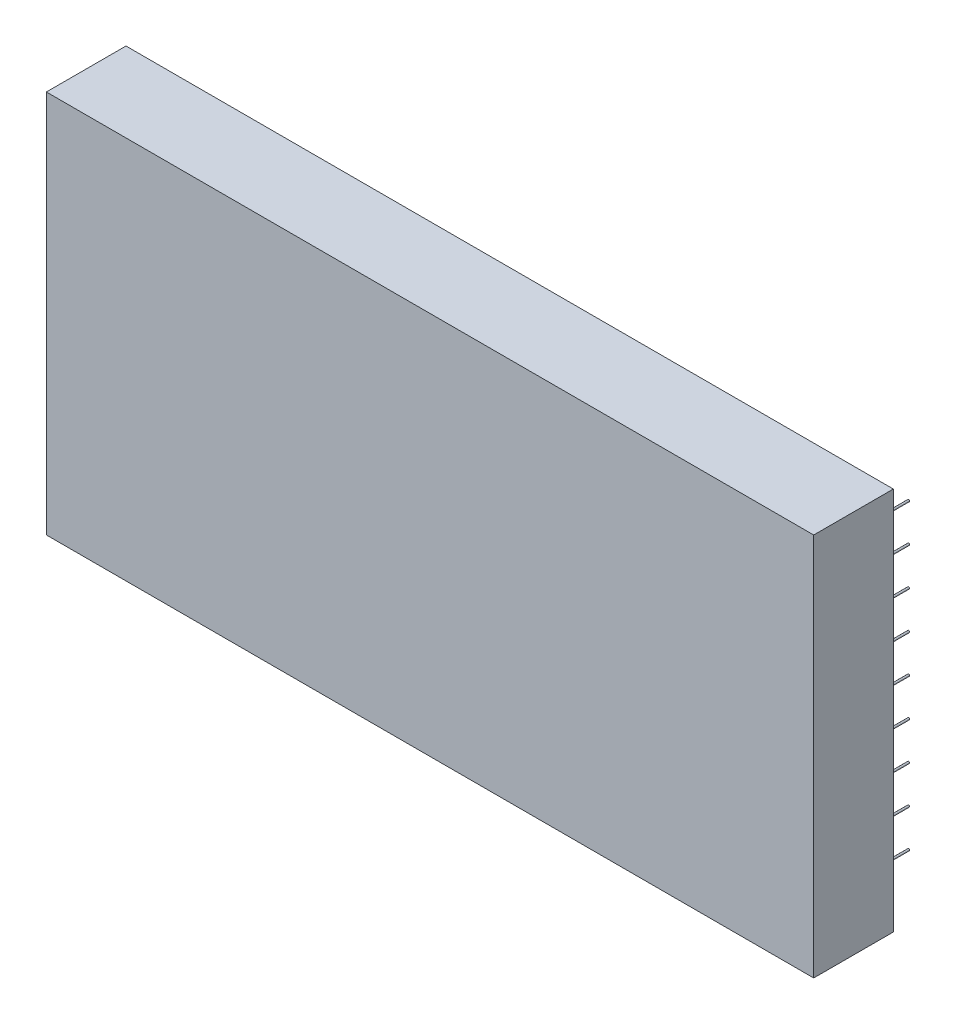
ISO-10303-21;
HEADER;
FILE_DESCRIPTION(('STEP AP214'),'2;1');
FILE_NAME('part.step','',(''),(''),'','','');
FILE_SCHEMA(('AUTOMOTIVE_DESIGN { 1 0 10303 214 1 1 1 1 }'));
ENDSEC;
DATA;
#1=APPLICATION_CONTEXT('core data for automotive mechanical design processes');
#2=APPLICATION_PROTOCOL_DEFINITION('international standard','automotive_design',2000,#1);
#3=PRODUCT_CONTEXT('',#1,'mechanical');
#4=PRODUCT('Part','Part','',(#3));
#5=PRODUCT_RELATED_PRODUCT_CATEGORY('part','',(#4));
#6=PRODUCT_DEFINITION_FORMATION('','',#4);
#7=PRODUCT_DEFINITION_CONTEXT('part definition',#1,'design');
#8=PRODUCT_DEFINITION('design','',#6,#7);
#9=PRODUCT_DEFINITION_SHAPE('','',#8);
#10=(LENGTH_UNIT() NAMED_UNIT(*) SI_UNIT(.MILLI.,.METRE.));
#11=(NAMED_UNIT(*) PLANE_ANGLE_UNIT() SI_UNIT($,.RADIAN.));
#12=(NAMED_UNIT(*) SI_UNIT($,.STERADIAN.) SOLID_ANGLE_UNIT());
#13=UNCERTAINTY_MEASURE_WITH_UNIT(LENGTH_MEASURE(1.E-05),#10,'distance_accuracy_value','');
#14=(GEOMETRIC_REPRESENTATION_CONTEXT(3) GLOBAL_UNCERTAINTY_ASSIGNED_CONTEXT((#13)) GLOBAL_UNIT_ASSIGNED_CONTEXT((#10,
#11,#12)) REPRESENTATION_CONTEXT('',''));
#15=CARTESIAN_POINT('',(0.,0.,0.));
#16=DIRECTION('',(0.,0.,1.));
#17=DIRECTION('',(1.,0.,0.));
#18=AXIS2_PLACEMENT_3D('',#15,#16,#17);
#19=CARTESIAN_POINT('',(1360.,20.,-400.));
#20=DIRECTION('',(0.,0.,-1.));
#21=DIRECTION('',(-1.,0.,0.));
#22=AXIS2_PLACEMENT_3D('',#19,#20,#21);
#23=PLANE('',#22);
#24=DIRECTION('',(0.,-1.,0.));
#25=VECTOR('',#24,1.);
#26=CARTESIAN_POINT('',(1350.,1.50492727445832,-400.));
#27=LINE('',#26,#25);
#28=CARTESIAN_POINT('',(1350.,3.,-400.));
#29=VERTEX_POINT('',#28);
#30=CARTESIAN_POINT('',(1350.,-3.,-400.));
#31=VERTEX_POINT('',#30);
#32=EDGE_CURVE('E445',#29,#31,#27,.T.);
#33=ORIENTED_EDGE('',*,*,#32,.F.);
#34=DIRECTION('',(1.,0.,0.));
#35=VECTOR('',#34,1.);
#36=CARTESIAN_POINT('',(1350.,3.,-400.));
#37=LINE('',#36,#35);
#38=CARTESIAN_POINT('',(1355.,3.,-400.));
#39=VERTEX_POINT('',#38);
#40=EDGE_CURVE('E461',#29,#39,#37,.T.);
#41=ORIENTED_EDGE('',*,*,#40,.T.);
#42=DIRECTION('',(0.,-1.,0.));
#43=VECTOR('',#42,1.);
#44=CARTESIAN_POINT('',(1355.,1.50492727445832,-400.));
#45=LINE('',#44,#43);
#46=CARTESIAN_POINT('',(1355.,-3.00000000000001,-400.));
#47=VERTEX_POINT('',#46);
#48=EDGE_CURVE('E437',#39,#47,#45,.T.);
#49=ORIENTED_EDGE('',*,*,#48,.T.);
#50=DIRECTION('',(1.,0.,0.));
#51=VECTOR('',#50,1.);
#52=CARTESIAN_POINT('',(1350.,-3.,-400.));
#53=LINE('',#52,#51);
#54=EDGE_CURVE('E59',#31,#47,#53,.T.);
#55=ORIENTED_EDGE('',*,*,#54,.F.);
#56=EDGE_LOOP('',(#33,#41,#49,#55));
#57=FACE_BOUND('',#56,.T.);
#58=CARTESIAN_POINT('',(1280.,0.,-400.));
#59=DIRECTION('',(0.,0.,-1.));
#60=DIRECTION('',(-1.,0.,0.));
#61=AXIS2_PLACEMENT_3D('',#58,#59,#60);
#62=CIRCLE('',#61,12.5);
#63=CARTESIAN_POINT('',(1267.5,0.,-400.));
#64=VERTEX_POINT('',#63);
#65=EDGE_CURVE('E550',#64,#64,#62,.T.);
#66=ORIENTED_EDGE('',*,*,#65,.T.);
#67=EDGE_LOOP('',(#66));
#68=FACE_BOUND('',#67,.T.);
#69=DIRECTION('',(1.,0.,0.));
#70=VECTOR('',#69,1.);
#71=CARTESIAN_POINT('',(960.000000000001,20.0000000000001,-400.));
#72=LINE('',#71,#70);
#73=CARTESIAN_POINT('',(1180.,20.,-400.));
#74=VERTEX_POINT('',#73);
#75=CARTESIAN_POINT('',(1360.,20.,-400.));
#76=VERTEX_POINT('',#75);
#77=EDGE_CURVE('E675',#74,#76,#72,.T.);
#78=ORIENTED_EDGE('',*,*,#77,.F.);
#79=DIRECTION('',(0.,-1.,0.));
#80=VECTOR('',#79,1.);
#81=CARTESIAN_POINT('',(1180.,-20.,-400.));
#82=LINE('',#81,#80);
#83=CARTESIAN_POINT('',(1180.,-20.,-400.));
#84=VERTEX_POINT('',#83);
#85=EDGE_CURVE('E709',#74,#84,#82,.T.);
#86=ORIENTED_EDGE('',*,*,#85,.T.);
#87=DIRECTION('',(-1.,0.,0.));
#88=VECTOR('',#87,1.);
#89=CARTESIAN_POINT('',(960.000000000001,-19.9999999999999,-400.));
#90=LINE('',#89,#88);
#91=CARTESIAN_POINT('',(1360.,-20.,-400.));
#92=VERTEX_POINT('',#91);
#93=EDGE_CURVE('E672',#92,#84,#90,.T.);
#94=ORIENTED_EDGE('',*,*,#93,.F.);
#95=DIRECTION('',(0.,-1.,0.));
#96=VECTOR('',#95,1.);
#97=CARTESIAN_POINT('',(1360.,-20.,-400.));
#98=LINE('',#97,#96);
#99=EDGE_CURVE('E649',#76,#92,#98,.T.);
#100=ORIENTED_EDGE('',*,*,#99,.F.);
#101=EDGE_LOOP('',(#78,#86,#94,#100));
#102=FACE_BOUND('',#101,.T.);
#103=DIRECTION('',(0.,-1.,0.));
#104=VECTOR('',#103,1.);
#105=CARTESIAN_POINT('',(1205.,1.50492727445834,-400.));
#106=LINE('',#105,#104);
#107=CARTESIAN_POINT('',(1205.,3.00000000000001,-400.));
#108=VERTEX_POINT('',#107);
#109=CARTESIAN_POINT('',(1205.,-2.99999999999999,-400.));
#110=VERTEX_POINT('',#109);
#111=EDGE_CURVE('E396',#108,#110,#106,.T.);
#112=ORIENTED_EDGE('',*,*,#111,.F.);
#113=DIRECTION('',(1.,0.,0.));
#114=VECTOR('',#113,1.);
#115=CARTESIAN_POINT('',(1205.,3.00000000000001,-400.));
#116=LINE('',#115,#114);
#117=CARTESIAN_POINT('',(1210.,3.00000000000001,-400.));
#118=VERTEX_POINT('',#117);
#119=EDGE_CURVE('E409',#108,#118,#116,.T.);
#120=ORIENTED_EDGE('',*,*,#119,.T.);
#121=DIRECTION('',(0.,-1.,0.));
#122=VECTOR('',#121,1.);
#123=CARTESIAN_POINT('',(1210.,1.50492727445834,-400.));
#124=LINE('',#123,#122);
#125=CARTESIAN_POINT('',(1210.,-2.99999999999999,-400.));
#126=VERTEX_POINT('',#125);
#127=EDGE_CURVE('E413',#118,#126,#124,.T.);
#128=ORIENTED_EDGE('',*,*,#127,.T.);
#129=DIRECTION('',(1.,0.,0.));
#130=VECTOR('',#129,1.);
#131=CARTESIAN_POINT('',(1205.,-2.99999999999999,-400.));
#132=LINE('',#131,#130);
#133=EDGE_CURVE('E51',#110,#126,#132,.T.);
#134=ORIENTED_EDGE('',*,*,#133,.F.);
#135=EDGE_LOOP('',(#112,#120,#128,#134));
#136=FACE_BOUND('',#135,.T.);
#137=ADVANCED_FACE('F35',(#57,#68,#102,#136),#23,.F.);
#138=CARTESIAN_POINT('',(995.000000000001,-9.99999999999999,-480.));
#139=DIRECTION('',(0.,-1.,0.));
#140=DIRECTION('',(0.,0.,-1.));
#141=AXIS2_PLACEMENT_3D('',#138,#139,#140);
#142=PLANE('',#141);
#143=DIRECTION('',(1.,0.,0.));
#144=VECTOR('',#143,1.);
#145=CARTESIAN_POINT('',(995.000000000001,-9.99999999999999,-440.));
#146=LINE('',#145,#144);
#147=CARTESIAN_POINT('',(980.000000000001,-9.99999999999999,-440.));
#148=VERTEX_POINT('',#147);
#149=CARTESIAN_POINT('',(995.000000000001,-9.99999999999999,-440.));
#150=VERTEX_POINT('',#149);
#151=EDGE_CURVE('E485',#148,#150,#146,.T.);
#152=ORIENTED_EDGE('',*,*,#151,.T.);
#153=DIRECTION('',(0.,0.,1.));
#154=VECTOR('',#153,1.);
#155=CARTESIAN_POINT('',(995.000000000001,-9.99999999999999,-480.));
#156=LINE('',#155,#154);
#157=CARTESIAN_POINT('',(995.000000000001,-9.99999999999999,-480.));
#158=VERTEX_POINT('',#157);
#159=EDGE_CURVE('E495',#158,#150,#156,.T.);
#160=ORIENTED_EDGE('',*,*,#159,.F.);
#161=DIRECTION('',(1.,0.,0.));
#162=VECTOR('',#161,1.);
#163=CARTESIAN_POINT('',(995.000000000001,-9.99999999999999,-480.));
#164=LINE('',#163,#162);
#165=CARTESIAN_POINT('',(980.000000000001,-9.99999999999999,-480.));
#166=VERTEX_POINT('',#165);
#167=EDGE_CURVE('E475',#166,#158,#164,.T.);
#168=ORIENTED_EDGE('',*,*,#167,.F.);
#169=DIRECTION('',(0.,0.,1.));
#170=VECTOR('',#169,1.);
#171=CARTESIAN_POINT('',(980.000000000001,-9.99999999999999,-480.));
#172=LINE('',#171,#170);
#173=EDGE_CURVE('E498',#166,#148,#172,.T.);
#174=ORIENTED_EDGE('',*,*,#173,.T.);
#175=EDGE_LOOP('',(#152,#160,#168,#174));
#176=FACE_BOUND('',#175,.T.);
#177=CARTESIAN_POINT('',(987.500000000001,-9.99999999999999,-472.));
#178=DIRECTION('',(0.,-1.,0.));
#179=DIRECTION('',(0.,0.,-1.));
#180=AXIS2_PLACEMENT_3D('',#177,#178,#179);
#181=CIRCLE('',#180,3.00000000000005);
#182=CARTESIAN_POINT('',(987.500000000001,-9.99999999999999,-475.));
#183=VERTEX_POINT('',#182);
#184=EDGE_CURVE('E11',#183,#183,#181,.F.);
#185=ORIENTED_EDGE('',*,*,#184,.F.);
#186=EDGE_LOOP('',(#185));
#187=FACE_BOUND('',#186,.T.);
#188=ADVANCED_FACE('F752',(#176,#187),#142,.F.);
#189=CARTESIAN_POINT('',(1360.,20.,-440.));
#190=DIRECTION('',(0.,0.,-1.));
#191=DIRECTION('',(-1.,0.,0.));
#192=AXIS2_PLACEMENT_3D('',#189,#190,#191);
#193=PLANE('',#192);
#194=CARTESIAN_POINT('',(987.500000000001,0.,-440.));
#195=DIRECTION('',(0.,0.,-1.));
#196=DIRECTION('',(-1.,0.,0.));
#197=AXIS2_PLACEMENT_3D('',#194,#195,#196);
#198=CIRCLE('',#197,2.49999999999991);
#199=CARTESIAN_POINT('',(985.000000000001,0.,-440.));
#200=VERTEX_POINT('',#199);
#201=EDGE_CURVE('E1146',#200,#200,#198,.T.);
#202=ORIENTED_EDGE('',*,*,#201,.F.);
#203=EDGE_LOOP('',(#202));
#204=FACE_BOUND('',#203,.T.);
#205=DIRECTION('',(1.,0.,0.));
#206=VECTOR('',#205,1.);
#207=CARTESIAN_POINT('',(1260.,5.,-440.));
#208=LINE('',#207,#206);
#209=CARTESIAN_POINT('',(1260.,5.,-440.));
#210=VERTEX_POINT('',#209);
#211=CARTESIAN_POINT('',(1265.,5.,-440.));
#212=VERTEX_POINT('',#211);
#213=EDGE_CURVE('E580',#210,#212,#208,.T.);
#214=ORIENTED_EDGE('',*,*,#213,.F.);
#215=DIRECTION('',(0.,-1.,0.));
#216=VECTOR('',#215,1.);
#217=CARTESIAN_POINT('',(1260.,-5.,-440.));
#218=LINE('',#217,#216);
#219=CARTESIAN_POINT('',(1260.,-5.,-440.));
#220=VERTEX_POINT('',#219);
#221=EDGE_CURVE('E562',#210,#220,#218,.T.);
#222=ORIENTED_EDGE('',*,*,#221,.T.);
#223=DIRECTION('',(1.,0.,0.));
#224=VECTOR('',#223,1.);
#225=CARTESIAN_POINT('',(1260.,-5.,-440.));
#226=LINE('',#225,#224);
#227=CARTESIAN_POINT('',(1265.,-5.,-440.));
#228=VERTEX_POINT('',#227);
#229=EDGE_CURVE('E578',#220,#228,#226,.T.);
#230=ORIENTED_EDGE('',*,*,#229,.T.);
#231=DIRECTION('',(0.,-1.,0.));
#232=VECTOR('',#231,1.);
#233=CARTESIAN_POINT('',(1265.,-5.,-440.));
#234=LINE('',#233,#232);
#235=EDGE_CURVE('E570',#212,#228,#234,.T.);
#236=ORIENTED_EDGE('',*,*,#235,.F.);
#237=EDGE_LOOP('',(#214,#222,#230,#236));
#238=FACE_BOUND('',#237,.T.);
#239=DIRECTION('',(1.,0.,0.));
#240=VECTOR('',#239,1.);
#241=CARTESIAN_POINT('',(1175.,5.00000000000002,-440.));
#242=LINE('',#241,#240);
#243=CARTESIAN_POINT('',(1175.,5.00000000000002,-440.));
#244=VERTEX_POINT('',#243);
#245=CARTESIAN_POINT('',(1180.,5.00000000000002,-440.));
#246=VERTEX_POINT('',#245);
#247=EDGE_CURVE('E535',#244,#246,#242,.T.);
#248=ORIENTED_EDGE('',*,*,#247,.F.);
#249=DIRECTION('',(0.,-1.,0.));
#250=VECTOR('',#249,1.);
#251=CARTESIAN_POINT('',(1175.,-4.99999999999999,-440.));
#252=LINE('',#251,#250);
#253=CARTESIAN_POINT('',(1175.,-4.99999999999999,-440.));
#254=VERTEX_POINT('',#253);
#255=EDGE_CURVE('E514',#244,#254,#252,.T.);
#256=ORIENTED_EDGE('',*,*,#255,.T.);
#257=DIRECTION('',(1.,0.,0.));
#258=VECTOR('',#257,1.);
#259=CARTESIAN_POINT('',(1175.,-4.99999999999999,-440.));
#260=LINE('',#259,#258);
#261=CARTESIAN_POINT('',(1180.,-4.99999999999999,-440.));
#262=VERTEX_POINT('',#261);
#263=EDGE_CURVE('E533',#254,#262,#260,.T.);
#264=ORIENTED_EDGE('',*,*,#263,.T.);
#265=DIRECTION('',(0.,-1.,0.));
#266=VECTOR('',#265,1.);
#267=CARTESIAN_POINT('',(1180.,-4.99999999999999,-440.));
#268=LINE('',#267,#266);
#269=EDGE_CURVE('E525',#246,#262,#268,.T.);
#270=ORIENTED_EDGE('',*,*,#269,.F.);
#271=EDGE_LOOP('',(#248,#256,#264,#270));
#272=FACE_BOUND('',#271,.T.);
#273=DIRECTION('',(1.,0.,0.));
#274=VECTOR('',#273,1.);
#275=CARTESIAN_POINT('',(960.000000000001,20.0000000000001,-440.));
#276=LINE('',#275,#274);
#277=CARTESIAN_POINT('',(960.000000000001,20.0000000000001,-440.));
#278=VERTEX_POINT('',#277);
#279=CARTESIAN_POINT('',(1360.,20.,-440.));
#280=VERTEX_POINT('',#279);
#281=EDGE_CURVE('E658',#278,#280,#276,.T.);
#282=ORIENTED_EDGE('',*,*,#281,.T.);
#283=DIRECTION('',(0.,-1.,0.));
#284=VECTOR('',#283,1.);
#285=CARTESIAN_POINT('',(1360.,-20.,-440.));
#286=LINE('',#285,#284);
#287=CARTESIAN_POINT('',(1360.,-20.,-440.));
#288=VERTEX_POINT('',#287);
#289=EDGE_CURVE('E650',#280,#288,#286,.T.);
#290=ORIENTED_EDGE('',*,*,#289,.T.);
#291=DIRECTION('',(-1.,0.,0.));
#292=VECTOR('',#291,1.);
#293=CARTESIAN_POINT('',(960.000000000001,-19.9999999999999,-440.));
#294=LINE('',#293,#292);
#295=CARTESIAN_POINT('',(960.000000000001,-19.9999999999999,-440.));
#296=VERTEX_POINT('',#295);
#297=EDGE_CURVE('E653',#288,#296,#294,.T.);
#298=ORIENTED_EDGE('',*,*,#297,.T.);
#299=DIRECTION('',(0.,1.,0.));
#300=VECTOR('',#299,1.);
#301=CARTESIAN_POINT('',(960.000000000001,-19.9999999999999,-440.));
#302=LINE('',#301,#300);
#303=EDGE_CURVE('E656',#296,#278,#302,.T.);
#304=ORIENTED_EDGE('',*,*,#303,.T.);
#305=EDGE_LOOP('',(#282,#290,#298,#304));
#306=FACE_BOUND('',#305,.T.);
#307=CARTESIAN_POINT('',(1280.,0.,-440.));
#308=DIRECTION('',(0.,0.,-1.));
#309=DIRECTION('',(-1.,0.,0.));
#310=AXIS2_PLACEMENT_3D('',#307,#308,#309);
#311=CIRCLE('',#310,12.5);
#312=CARTESIAN_POINT('',(1267.5,0.,-440.));
#313=VERTEX_POINT('',#312);
#314=EDGE_CURVE('E545',#313,#313,#311,.T.);
#315=ORIENTED_EDGE('',*,*,#314,.F.);
#316=EDGE_LOOP('',(#315));
#317=FACE_BOUND('',#316,.T.);
#318=ORIENTED_EDGE('',*,*,#151,.F.);
#319=DIRECTION('',(0.,1.,0.));
#320=VECTOR('',#319,1.);
#321=CARTESIAN_POINT('',(980.000000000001,-15.,-440.));
#322=LINE('',#321,#320);
#323=CARTESIAN_POINT('',(980.000000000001,-15.,-440.));
#324=VERTEX_POINT('',#323);
#325=EDGE_CURVE('E471',#324,#148,#322,.T.);
#326=ORIENTED_EDGE('',*,*,#325,.F.);
#327=DIRECTION('',(-1.,0.,0.));
#328=VECTOR('',#327,1.);
#329=CARTESIAN_POINT('',(995.000000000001,-15.,-440.));
#330=LINE('',#329,#328);
#331=CARTESIAN_POINT('',(995.000000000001,-15.,-440.));
#332=VERTEX_POINT('',#331);
#333=EDGE_CURVE('E476',#332,#324,#330,.T.);
#334=ORIENTED_EDGE('',*,*,#333,.F.);
#335=DIRECTION('',(0.,-1.,0.));
#336=VECTOR('',#335,1.);
#337=CARTESIAN_POINT('',(995.000000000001,-15.,-440.));
#338=LINE('',#337,#336);
#339=EDGE_CURVE('E487',#150,#332,#338,.T.);
#340=ORIENTED_EDGE('',*,*,#339,.F.);
#341=EDGE_LOOP('',(#318,#326,#334,#340));
#342=FACE_BOUND('',#341,.T.);
#343=ADVANCED_FACE('F759',(#204,#238,#272,#306,#317,#342),#193,.T.);
#344=CARTESIAN_POINT('',(1265.,0.,-470.));
#345=DIRECTION('',(1.,0.,0.));
#346=DIRECTION('',(0.,0.,-1.));
#347=AXIS2_PLACEMENT_3D('',#344,#345,#346);
#348=PLANE('',#347);
#349=DIRECTION('',(0.,0.,-1.));
#350=VECTOR('',#349,1.);
#351=CARTESIAN_POINT('',(1265.,-4.99999999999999,-464.40983005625));
#352=LINE('',#351,#350);
#353=CARTESIAN_POINT('',(1265.,-4.99999999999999,-464.40983005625));
#354=VERTEX_POINT('',#353);
#355=EDGE_CURVE('E559',#228,#354,#352,.T.);
#356=ORIENTED_EDGE('',*,*,#355,.T.);
#357=CARTESIAN_POINT('',(1265.,0.,-470.));
#358=DIRECTION('',(1.,0.,0.));
#359=DIRECTION('',(0.,0.,-1.));
#360=AXIS2_PLACEMENT_3D('',#357,#358,#359);
#361=CIRCLE('',#360,7.50000000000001);
#362=CARTESIAN_POINT('',(1265.,4.99999999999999,-464.40983005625));
#363=VERTEX_POINT('',#362);
#364=EDGE_CURVE('E541',#363,#354,#361,.T.);
#365=ORIENTED_EDGE('',*,*,#364,.F.);
#366=DIRECTION('',(0.,0.,1.));
#367=VECTOR('',#366,1.);
#368=CARTESIAN_POINT('',(1265.,5.,-440.));
#369=LINE('',#368,#367);
#370=EDGE_CURVE('E554',#363,#212,#369,.T.);
#371=ORIENTED_EDGE('',*,*,#370,.T.);
#372=ORIENTED_EDGE('',*,*,#235,.T.);
#373=EDGE_LOOP('',(#356,#365,#371,#372));
#374=FACE_BOUND('',#373,.T.);
#375=ADVANCED_FACE('F1062',(#374),#348,.T.);
#376=CARTESIAN_POINT('',(2000.,-1000.,0.));
#377=DIRECTION('',(0.,0.,1.));
#378=DIRECTION('',(1.,0.,0.));
#379=AXIS2_PLACEMENT_3D('',#376,#377,#378);
#380=PLANE('',#379);
#381=DIRECTION('',(0.,-1.,0.));
#382=VECTOR('',#381,1.);
#383=CARTESIAN_POINT('',(1180.,-20.,0.));
#384=LINE('',#383,#382);
#385=CARTESIAN_POINT('',(1180.,20.,0.));
#386=VERTEX_POINT('',#385);
#387=CARTESIAN_POINT('',(1180.,-20.0000000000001,0.));
#388=VERTEX_POINT('',#387);
#389=EDGE_CURVE('E703',#386,#388,#384,.T.);
#390=ORIENTED_EDGE('',*,*,#389,.F.);
#391=DIRECTION('',(1.,0.,0.));
#392=VECTOR('',#391,1.);
#393=CARTESIAN_POINT('',(1140.,20.,0.));
#394=LINE('',#393,#392);
#395=CARTESIAN_POINT('',(1140.,19.9999999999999,0.));
#396=VERTEX_POINT('',#395);
#397=EDGE_CURVE('E714',#396,#386,#394,.T.);
#398=ORIENTED_EDGE('',*,*,#397,.F.);
#399=DIRECTION('',(0.,1.,0.));
#400=VECTOR('',#399,1.);
#401=CARTESIAN_POINT('',(1140.,-20.,0.));
#402=LINE('',#401,#400);
#403=CARTESIAN_POINT('',(1140.,-19.9999999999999,0.));
#404=VERTEX_POINT('',#403);
#405=EDGE_CURVE('E808',#404,#396,#402,.T.);
#406=ORIENTED_EDGE('',*,*,#405,.F.);
#407=DIRECTION('',(-1.,0.,0.));
#408=VECTOR('',#407,1.);
#409=CARTESIAN_POINT('',(1140.,-20.,0.));
#410=LINE('',#409,#408);
#411=EDGE_CURVE('E803',#388,#404,#410,.T.);
#412=ORIENTED_EDGE('',*,*,#411,.F.);
#413=EDGE_LOOP('',(#390,#398,#406,#412));
#414=FACE_BOUND('',#413,.T.);
#415=CARTESIAN_POINT('',(360.000000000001,0.,0.));
#416=DIRECTION('',(0.,0.,1.));
#417=DIRECTION('',(1.,0.,0.));
#418=AXIS2_PLACEMENT_3D('',#415,#416,#417);
#419=CIRCLE('',#418,17.5);
#420=CARTESIAN_POINT('',(377.500000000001,0.,0.));
#421=VERTEX_POINT('',#420);
#422=EDGE_CURVE('E1027',#421,#421,#419,.F.);
#423=ORIENTED_EDGE('',*,*,#422,.F.);
#424=EDGE_LOOP('',(#423));
#425=FACE_BOUND('',#424,.T.);
#426=CARTESIAN_POINT('',(1880.,788.,0.));
#427=DIRECTION('',(0.,0.,1.));
#428=DIRECTION('',(1.,0.,0.));
#429=AXIS2_PLACEMENT_3D('',#426,#427,#428);
#430=CIRCLE('',#429,4.99999999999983);
#431=CARTESIAN_POINT('',(1885.,788.,0.));
#432=VERTEX_POINT('',#431);
#433=EDGE_CURVE('E1021',#432,#432,#430,.F.);
#434=ORIENTED_EDGE('',*,*,#433,.F.);
#435=EDGE_LOOP('',(#434));
#436=FACE_BOUND('',#435,.T.);
#437=CARTESIAN_POINT('',(1880.,394.,0.));
#438=DIRECTION('',(0.,0.,1.));
#439=DIRECTION('',(1.,0.,0.));
#440=AXIS2_PLACEMENT_3D('',#437,#438,#439);
#441=CIRCLE('',#440,4.99999999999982);
#442=CARTESIAN_POINT('',(1885.,394.,0.));
#443=VERTEX_POINT('',#442);
#444=EDGE_CURVE('E1015',#443,#443,#441,.F.);
#445=ORIENTED_EDGE('',*,*,#444,.F.);
#446=EDGE_LOOP('',(#445));
#447=FACE_BOUND('',#446,.T.);
#448=CARTESIAN_POINT('',(1880.,-2.22044604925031E-13,0.));
#449=DIRECTION('',(0.,0.,1.));
#450=DIRECTION('',(1.,0.,0.));
#451=AXIS2_PLACEMENT_3D('',#448,#449,#450);
#452=CIRCLE('',#451,4.99999999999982);
#453=CARTESIAN_POINT('',(1885.,-2.22044604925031E-13,0.));
#454=VERTEX_POINT('',#453);
#455=EDGE_CURVE('E1009',#454,#454,#452,.F.);
#456=ORIENTED_EDGE('',*,*,#455,.F.);
#457=EDGE_LOOP('',(#456));
#458=FACE_BOUND('',#457,.T.);
#459=CARTESIAN_POINT('',(1880.,-394.,0.));
#460=DIRECTION('',(0.,0.,1.));
#461=DIRECTION('',(1.,0.,0.));
#462=AXIS2_PLACEMENT_3D('',#459,#460,#461);
#463=CIRCLE('',#462,4.99999999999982);
#464=CARTESIAN_POINT('',(1885.,-394.,0.));
#465=VERTEX_POINT('',#464);
#466=EDGE_CURVE('E1003',#465,#465,#463,.F.);
#467=ORIENTED_EDGE('',*,*,#466,.F.);
#468=EDGE_LOOP('',(#467));
#469=FACE_BOUND('',#468,.T.);
#470=CARTESIAN_POINT('',(1880.,-788.,0.));
#471=DIRECTION('',(0.,0.,1.));
#472=DIRECTION('',(1.,0.,0.));
#473=AXIS2_PLACEMENT_3D('',#470,#471,#472);
#474=CIRCLE('',#473,4.99999999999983);
#475=CARTESIAN_POINT('',(1885.,-788.,0.));
#476=VERTEX_POINT('',#475);
#477=EDGE_CURVE('E997',#476,#476,#474,.F.);
#478=ORIENTED_EDGE('',*,*,#477,.F.);
#479=EDGE_LOOP('',(#478));
#480=FACE_BOUND('',#479,.T.);
#481=DIRECTION('',(0.,1.,0.));
#482=VECTOR('',#481,1.);
#483=CARTESIAN_POINT('',(2000.,1000.,0.));
#484=LINE('',#483,#482);
#485=CARTESIAN_POINT('',(2000.,-1000.,0.));
#486=VERTEX_POINT('',#485);
#487=CARTESIAN_POINT('',(2000.,1000.,0.));
#488=VERTEX_POINT('',#487);
#489=EDGE_CURVE('E963',#486,#488,#484,.T.);
#490=ORIENTED_EDGE('',*,*,#489,.F.);
#491=DIRECTION('',(1.,0.,0.));
#492=VECTOR('',#491,1.);
#493=CARTESIAN_POINT('',(-2000.,-1000.,0.));
#494=LINE('',#493,#492);
#495=CARTESIAN_POINT('',(-2000.,-1000.,0.));
#496=VERTEX_POINT('',#495);
#497=EDGE_CURVE('E968',#496,#486,#494,.T.);
#498=ORIENTED_EDGE('',*,*,#497,.F.);
#499=DIRECTION('',(0.,-1.,0.));
#500=VECTOR('',#499,1.);
#501=CARTESIAN_POINT('',(-2000.,1000.,0.));
#502=LINE('',#501,#500);
#503=CARTESIAN_POINT('',(-2000.,1000.,0.));
#504=VERTEX_POINT('',#503);
#505=EDGE_CURVE('E979',#504,#496,#502,.T.);
#506=ORIENTED_EDGE('',*,*,#505,.F.);
#507=DIRECTION('',(-1.,0.,0.));
#508=VECTOR('',#507,1.);
#509=CARTESIAN_POINT('',(-2000.,1000.,0.));
#510=LINE('',#509,#508);
#511=EDGE_CURVE('E977',#488,#504,#510,.T.);
#512=ORIENTED_EDGE('',*,*,#511,.F.);
#513=EDGE_LOOP('',(#490,#498,#506,#512));
#514=FACE_BOUND('',#513,.T.);
#515=DIRECTION('',(1.,0.,0.));
#516=VECTOR('',#515,1.);
#517=CARTESIAN_POINT('',(-269.999999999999,835.,0.));
#518=LINE('',#517,#516);
#519=CARTESIAN_POINT('',(-869.999999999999,835.,0.));
#520=VERTEX_POINT('',#519);
#521=CARTESIAN_POINT('',(-269.999999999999,835.,0.));
#522=VERTEX_POINT('',#521);
#523=EDGE_CURVE('E879',#520,#522,#518,.T.);
#524=ORIENTED_EDGE('',*,*,#523,.F.);
#525=DIRECTION('',(0.,1.,0.));
#526=VECTOR('',#525,1.);
#527=CARTESIAN_POINT('',(-869.999999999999,835.,0.));
#528=LINE('',#527,#526);
#529=CARTESIAN_POINT('',(-869.999999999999,-485.,0.));
#530=VERTEX_POINT('',#529);
#531=EDGE_CURVE('E874',#530,#520,#528,.T.);
#532=ORIENTED_EDGE('',*,*,#531,.F.);
#533=DIRECTION('',(-1.,0.,0.));
#534=VECTOR('',#533,1.);
#535=CARTESIAN_POINT('',(-269.999999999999,-485.,0.));
#536=LINE('',#535,#534);
#537=CARTESIAN_POINT('',(-969.999999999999,-485.,0.));
#538=VERTEX_POINT('',#537);
#539=EDGE_CURVE('E908',#530,#538,#536,.T.);
#540=ORIENTED_EDGE('',*,*,#539,.T.);
#541=DIRECTION('',(0.,-1.,0.));
#542=VECTOR('',#541,1.);
#543=CARTESIAN_POINT('',(-969.999999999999,-485.,-6.04975518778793E-13));
#544=LINE('',#543,#542);
#545=CARTESIAN_POINT('',(-969.999999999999,-985.,-6.04975518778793E-13));
#546=VERTEX_POINT('',#545);
#547=EDGE_CURVE('E948',#538,#546,#544,.T.);
#548=ORIENTED_EDGE('',*,*,#547,.T.);
#549=DIRECTION('',(1.,0.,0.));
#550=VECTOR('',#549,1.);
#551=CARTESIAN_POINT('',(-269.999999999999,-985.,0.));
#552=LINE('',#551,#550);
#553=CARTESIAN_POINT('',(-269.999999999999,-985.,0.));
#554=VERTEX_POINT('',#553);
#555=EDGE_CURVE('E849',#546,#554,#552,.T.);
#556=ORIENTED_EDGE('',*,*,#555,.T.);
#557=DIRECTION('',(0.,-1.,0.));
#558=VECTOR('',#557,1.);
#559=CARTESIAN_POINT('',(-269.999999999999,-485.,0.));
#560=LINE('',#559,#558);
#561=EDGE_CURVE('E951',#522,#554,#560,.T.);
#562=ORIENTED_EDGE('',*,*,#561,.F.);
#563=EDGE_LOOP('',(#524,#532,#540,#548,#556,#562));
#564=FACE_BOUND('',#563,.T.);
#565=CARTESIAN_POINT('',(1880.,-591.,0.));
#566=DIRECTION('',(0.,0.,1.));
#567=DIRECTION('',(1.,0.,0.));
#568=AXIS2_PLACEMENT_3D('',#565,#566,#567);
#569=CIRCLE('',#568,4.99999999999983);
#570=CARTESIAN_POINT('',(1885.,-591.,0.));
#571=VERTEX_POINT('',#570);
#572=EDGE_CURVE('E1000',#571,#571,#569,.F.);
#573=ORIENTED_EDGE('',*,*,#572,.F.);
#574=EDGE_LOOP('',(#573));
#575=FACE_BOUND('',#574,.T.);
#576=CARTESIAN_POINT('',(1880.,-197.,0.));
#577=DIRECTION('',(0.,0.,1.));
#578=DIRECTION('',(1.,0.,0.));
#579=AXIS2_PLACEMENT_3D('',#576,#577,#578);
#580=CIRCLE('',#579,4.99999999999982);
#581=CARTESIAN_POINT('',(1885.,-197.,0.));
#582=VERTEX_POINT('',#581);
#583=EDGE_CURVE('E1006',#582,#582,#580,.F.);
#584=ORIENTED_EDGE('',*,*,#583,.F.);
#585=EDGE_LOOP('',(#584));
#586=FACE_BOUND('',#585,.T.);
#587=CARTESIAN_POINT('',(1880.,197.,0.));
#588=DIRECTION('',(0.,0.,1.));
#589=DIRECTION('',(1.,0.,0.));
#590=AXIS2_PLACEMENT_3D('',#587,#588,#589);
#591=CIRCLE('',#590,4.99999999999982);
#592=CARTESIAN_POINT('',(1885.,197.,0.));
#593=VERTEX_POINT('',#592);
#594=EDGE_CURVE('E1012',#593,#593,#591,.F.);
#595=ORIENTED_EDGE('',*,*,#594,.F.);
#596=EDGE_LOOP('',(#595));
#597=FACE_BOUND('',#596,.T.);
#598=CARTESIAN_POINT('',(1880.,591.,0.));
#599=DIRECTION('',(0.,0.,1.));
#600=DIRECTION('',(1.,0.,0.));
#601=AXIS2_PLACEMENT_3D('',#598,#599,#600);
#602=CIRCLE('',#601,4.99999999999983);
#603=CARTESIAN_POINT('',(1885.,591.,0.));
#604=VERTEX_POINT('',#603);
#605=EDGE_CURVE('E1018',#604,#604,#602,.F.);
#606=ORIENTED_EDGE('',*,*,#605,.F.);
#607=EDGE_LOOP('',(#606));
#608=FACE_BOUND('',#607,.T.);
#609=CARTESIAN_POINT('',(60.0000000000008,0.,0.));
#610=DIRECTION('',(0.,0.,1.));
#611=DIRECTION('',(1.,0.,0.));
#612=AXIS2_PLACEMENT_3D('',#609,#610,#611);
#613=CIRCLE('',#612,22.5);
#614=CARTESIAN_POINT('',(82.5000000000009,0.,0.));
#615=VERTEX_POINT('',#614);
#616=EDGE_CURVE('E1024',#615,#615,#613,.F.);
#617=ORIENTED_EDGE('',*,*,#616,.F.);
#618=EDGE_LOOP('',(#617));
#619=FACE_BOUND('',#618,.T.);
#620=CARTESIAN_POINT('',(660.000000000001,0.,0.));
#621=DIRECTION('',(0.,0.,1.));
#622=DIRECTION('',(1.,0.,0.));
#623=AXIS2_PLACEMENT_3D('',#620,#621,#622);
#624=CIRCLE('',#623,12.5);
#625=CARTESIAN_POINT('',(672.500000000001,0.,0.));
#626=VERTEX_POINT('',#625);
#627=EDGE_CURVE('E1030',#626,#626,#624,.F.);
#628=ORIENTED_EDGE('',*,*,#627,.F.);
#629=EDGE_LOOP('',(#628));
#630=FACE_BOUND('',#629,.T.);
#631=DIRECTION('',(-1.,0.,0.));
#632=VECTOR('',#631,1.);
#633=CARTESIAN_POINT('',(-1670.,150.,0.));
#634=LINE('',#633,#632);
#635=CARTESIAN_POINT('',(-1670.,150.,0.));
#636=VERTEX_POINT('',#635);
#637=CARTESIAN_POINT('',(-1970.,150.,0.));
#638=VERTEX_POINT('',#637);
#639=EDGE_CURVE('E577',#636,#638,#634,.T.);
#640=ORIENTED_EDGE('',*,*,#639,.F.);
#641=DIRECTION('',(0.,-1.,0.));
#642=VECTOR('',#641,1.);
#643=CARTESIAN_POINT('',(-1670.,165.,0.));
#644=LINE('',#643,#642);
#645=CARTESIAN_POINT('',(-1670.,165.,0.));
#646=VERTEX_POINT('',#645);
#647=EDGE_CURVE('E589',#646,#636,#644,.T.);
#648=ORIENTED_EDGE('',*,*,#647,.F.);
#649=DIRECTION('',(1.,0.,0.));
#650=VECTOR('',#649,1.);
#651=CARTESIAN_POINT('',(-1985.,165.,0.));
#652=LINE('',#651,#650);
#653=CARTESIAN_POINT('',(-1985.,165.,0.));
#654=VERTEX_POINT('',#653);
#655=EDGE_CURVE('E621',#654,#646,#652,.T.);
#656=ORIENTED_EDGE('',*,*,#655,.F.);
#657=DIRECTION('',(0.,1.,0.));
#658=VECTOR('',#657,1.);
#659=CARTESIAN_POINT('',(-1985.,165.,0.));
#660=LINE('',#659,#658);
#661=CARTESIAN_POINT('',(-1985.,-165.,0.));
#662=VERTEX_POINT('',#661);
#663=EDGE_CURVE('E618',#662,#654,#660,.T.);
#664=ORIENTED_EDGE('',*,*,#663,.F.);
#665=DIRECTION('',(-1.,0.,0.));
#666=VECTOR('',#665,1.);
#667=CARTESIAN_POINT('',(-1985.,-165.,0.));
#668=LINE('',#667,#666);
#669=CARTESIAN_POINT('',(-1670.,-165.,0.));
#670=VERTEX_POINT('',#669);
#671=EDGE_CURVE('E615',#670,#662,#668,.T.);
#672=ORIENTED_EDGE('',*,*,#671,.F.);
#673=DIRECTION('',(0.,-1.,0.));
#674=VECTOR('',#673,1.);
#675=CARTESIAN_POINT('',(-1670.,-165.,0.));
#676=LINE('',#675,#674);
#677=CARTESIAN_POINT('',(-1670.,-150.,0.));
#678=VERTEX_POINT('',#677);
#679=EDGE_CURVE('E612',#678,#670,#676,.T.);
#680=ORIENTED_EDGE('',*,*,#679,.F.);
#681=DIRECTION('',(1.,0.,0.));
#682=VECTOR('',#681,1.);
#683=CARTESIAN_POINT('',(-1670.,-150.,0.));
#684=LINE('',#683,#682);
#685=CARTESIAN_POINT('',(-1970.,-150.,0.));
#686=VERTEX_POINT('',#685);
#687=EDGE_CURVE('E609',#686,#678,#684,.T.);
#688=ORIENTED_EDGE('',*,*,#687,.F.);
#689=DIRECTION('',(0.,-1.,0.));
#690=VECTOR('',#689,1.);
#691=CARTESIAN_POINT('',(-1970.,-150.,0.));
#692=LINE('',#691,#690);
#693=EDGE_CURVE('E606',#638,#686,#692,.T.);
#694=ORIENTED_EDGE('',*,*,#693,.F.);
#695=EDGE_LOOP('',(#640,#648,#656,#664,#672,#680,#688,#694));
#696=FACE_BOUND('',#695,.T.);
#697=ADVANCED_FACE('F1058',(#414,#425,#436,#447,#458,#469,#480,#514,#564,#575,#586,#597,#608,
#619,#630,#696),#380,.F.);
#698=CARTESIAN_POINT('',(660.000000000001,0.,-14.));
#699=DIRECTION('',(0.,0.,-1.));
#700=DIRECTION('',(-1.,0.,0.));
#701=AXIS2_PLACEMENT_3D('',#698,#699,#700);
#702=PLANE('',#701);
#703=CARTESIAN_POINT('',(660.000000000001,0.,-14.));
#704=DIRECTION('',(0.,0.,-1.));
#705=DIRECTION('',(-1.,0.,0.));
#706=AXIS2_PLACEMENT_3D('',#703,#704,#705);
#707=CIRCLE('',#706,12.5);
#708=CARTESIAN_POINT('',(647.500000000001,0.,-14.));
#709=VERTEX_POINT('',#708);
#710=EDGE_CURVE('E720',#709,#709,#707,.T.);
#711=ORIENTED_EDGE('',*,*,#710,.T.);
#712=EDGE_LOOP('',(#711));
#713=FACE_BOUND('',#712,.T.);
#714=CARTESIAN_POINT('',(660.000000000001,0.,-14.));
#715=DIRECTION('',(0.,0.,-1.));
#716=DIRECTION('',(-1.,0.,0.));
#717=AXIS2_PLACEMENT_3D('',#714,#715,#716);
#718=CIRCLE('',#717,7.99999999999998);
#719=CARTESIAN_POINT('',(652.000000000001,0.,-14.));
#720=VERTEX_POINT('',#719);
#721=EDGE_CURVE('E690',#720,#720,#718,.T.);
#722=ORIENTED_EDGE('',*,*,#721,.F.);
#723=EDGE_LOOP('',(#722));
#724=FACE_BOUND('',#723,.T.);
#725=ADVANCED_FACE('F1061',(#713,#724),#702,.T.);
#726=CARTESIAN_POINT('',(360.000000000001,0.,-20.));
#727=DIRECTION('',(0.,0.,-1.));
#728=DIRECTION('',(-1.,0.,0.));
#729=AXIS2_PLACEMENT_3D('',#726,#727,#728);
#730=PLANE('',#729);
#731=CARTESIAN_POINT('',(360.000000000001,0.,-20.));
#732=DIRECTION('',(0.,0.,-1.));
#733=DIRECTION('',(-1.,0.,0.));
#734=AXIS2_PLACEMENT_3D('',#731,#732,#733);
#735=CIRCLE('',#734,17.5);
#736=CARTESIAN_POINT('',(342.500000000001,0.,-20.));
#737=VERTEX_POINT('',#736);
#738=EDGE_CURVE('E816',#737,#737,#735,.T.);
#739=ORIENTED_EDGE('',*,*,#738,.T.);
#740=EDGE_LOOP('',(#739));
#741=FACE_BOUND('',#740,.T.);
#742=CARTESIAN_POINT('',(360.000000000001,0.,-20.));
#743=DIRECTION('',(0.,0.,-1.));
#744=DIRECTION('',(-1.,0.,0.));
#745=AXIS2_PLACEMENT_3D('',#742,#743,#744);
#746=CIRCLE('',#745,12.);
#747=CARTESIAN_POINT('',(348.000000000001,0.,-20.));
#748=VERTEX_POINT('',#747);
#749=EDGE_CURVE('E694',#748,#748,#746,.T.);
#750=ORIENTED_EDGE('',*,*,#749,.F.);
#751=EDGE_LOOP('',(#750));
#752=FACE_BOUND('',#751,.T.);
#753=ADVANCED_FACE('F1599',(#741,#752),#730,.T.);
#754=CARTESIAN_POINT('',(60.0000000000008,0.,-25.));
#755=DIRECTION('',(0.,0.,-1.));
#756=DIRECTION('',(-1.,0.,0.));
#757=AXIS2_PLACEMENT_3D('',#754,#755,#756);
#758=PLANE('',#757);
#759=CARTESIAN_POINT('',(60.0000000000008,0.,-25.));
#760=DIRECTION('',(0.,0.,-1.));
#761=DIRECTION('',(-1.,0.,0.));
#762=AXIS2_PLACEMENT_3D('',#759,#760,#761);
#763=CIRCLE('',#762,22.5);
#764=CARTESIAN_POINT('',(37.5000000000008,0.,-25.));
#765=VERTEX_POINT('',#764);
#766=EDGE_CURVE('E819',#765,#765,#763,.T.);
#767=ORIENTED_EDGE('',*,*,#766,.T.);
#768=EDGE_LOOP('',(#767));
#769=FACE_BOUND('',#768,.T.);
#770=CARTESIAN_POINT('',(60.0000000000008,0.,-25.));
#771=DIRECTION('',(0.,0.,-1.));
#772=DIRECTION('',(-1.,0.,0.));
#773=AXIS2_PLACEMENT_3D('',#770,#771,#772);
#774=CIRCLE('',#773,15.);
#775=CARTESIAN_POINT('',(45.0000000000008,0.,-25.));
#776=VERTEX_POINT('',#775);
#777=EDGE_CURVE('E698',#776,#776,#774,.T.);
#778=ORIENTED_EDGE('',*,*,#777,.F.);
#779=EDGE_LOOP('',(#778));
#780=FACE_BOUND('',#779,.T.);
#781=ADVANCED_FACE('F1608',(#769,#780),#758,.T.);
#782=CARTESIAN_POINT('',(-2000.,-1000.,415.));
#783=DIRECTION('',(0.,1.,0.));
#784=DIRECTION('',(0.,0.,1.));
#785=AXIS2_PLACEMENT_3D('',#782,#783,#784);
#786=PLANE('',#785);
#787=DIRECTION('',(0.,0.,-1.));
#788=VECTOR('',#787,1.);
#789=CARTESIAN_POINT('',(2000.,-1000.,415.));
#790=LINE('',#789,#788);
#791=CARTESIAN_POINT('',(2000.,-1000.,415.));
#792=VERTEX_POINT('',#791);
#793=EDGE_CURVE('E974',#792,#486,#790,.T.);
#794=ORIENTED_EDGE('',*,*,#793,.F.);
#795=DIRECTION('',(1.,0.,0.));
#796=VECTOR('',#795,1.);
#797=CARTESIAN_POINT('',(-2000.,-1000.,415.));
#798=LINE('',#797,#796);
#799=CARTESIAN_POINT('',(-2000.,-1000.,415.));
#800=VERTEX_POINT('',#799);
#801=EDGE_CURVE('E972',#800,#792,#798,.T.);
#802=ORIENTED_EDGE('',*,*,#801,.F.);
#803=DIRECTION('',(0.,0.,-1.));
#804=VECTOR('',#803,1.);
#805=CARTESIAN_POINT('',(-2000.,-1000.,415.));
#806=LINE('',#805,#804);
#807=EDGE_CURVE('E984',#800,#496,#806,.T.);
#808=ORIENTED_EDGE('',*,*,#807,.T.);
#809=ORIENTED_EDGE('',*,*,#497,.T.);
#810=EDGE_LOOP('',(#794,#802,#808,#809));
#811=FACE_BOUND('',#810,.T.);
#812=ADVANCED_FACE('F1616',(#811),#786,.F.);
#813=CARTESIAN_POINT('',(2000.,1000.,415.));
#814=DIRECTION('',(-1.,0.,0.));
#815=DIRECTION('',(0.,-1.,0.));
#816=AXIS2_PLACEMENT_3D('',#813,#814,#815);
#817=PLANE('',#816);
#818=ORIENTED_EDGE('',*,*,#489,.T.);
#819=DIRECTION('',(0.,0.,-1.));
#820=VECTOR('',#819,1.);
#821=CARTESIAN_POINT('',(2000.,1000.,415.));
#822=LINE('',#821,#820);
#823=CARTESIAN_POINT('',(2000.,1000.,415.));
#824=VERTEX_POINT('',#823);
#825=EDGE_CURVE('E990',#824,#488,#822,.T.);
#826=ORIENTED_EDGE('',*,*,#825,.F.);
#827=DIRECTION('',(0.,1.,0.));
#828=VECTOR('',#827,1.);
#829=CARTESIAN_POINT('',(2000.,1000.,415.));
#830=LINE('',#829,#828);
#831=EDGE_CURVE('E964',#792,#824,#830,.T.);
#832=ORIENTED_EDGE('',*,*,#831,.F.);
#833=ORIENTED_EDGE('',*,*,#793,.T.);
#834=EDGE_LOOP('',(#818,#826,#832,#833));
#835=FACE_BOUND('',#834,.T.);
#836=ADVANCED_FACE('F1625',(#835),#817,.F.);
#837=CARTESIAN_POINT('',(-2000.,1000.,415.));
#838=DIRECTION('',(0.,-1.,0.));
#839=DIRECTION('',(0.,0.,-1.));
#840=AXIS2_PLACEMENT_3D('',#837,#838,#839);
#841=PLANE('',#840);
#842=ORIENTED_EDGE('',*,*,#511,.T.);
#843=DIRECTION('',(0.,0.,-1.));
#844=VECTOR('',#843,1.);
#845=CARTESIAN_POINT('',(-2000.,1000.,415.));
#846=LINE('',#845,#844);
#847=CARTESIAN_POINT('',(-2000.,1000.,415.));
#848=VERTEX_POINT('',#847);
#849=EDGE_CURVE('E987',#848,#504,#846,.T.);
#850=ORIENTED_EDGE('',*,*,#849,.F.);
#851=DIRECTION('',(-1.,0.,0.));
#852=VECTOR('',#851,1.);
#853=CARTESIAN_POINT('',(-2000.,1000.,415.));
#854=LINE('',#853,#852);
#855=EDGE_CURVE('E967',#824,#848,#854,.T.);
#856=ORIENTED_EDGE('',*,*,#855,.F.);
#857=ORIENTED_EDGE('',*,*,#825,.T.);
#858=EDGE_LOOP('',(#842,#850,#856,#857));
#859=FACE_BOUND('',#858,.T.);
#860=ADVANCED_FACE('F1635',(#859),#841,.F.);
#861=CARTESIAN_POINT('',(-2000.,1000.,415.));
#862=DIRECTION('',(1.,0.,0.));
#863=DIRECTION('',(0.,1.,0.));
#864=AXIS2_PLACEMENT_3D('',#861,#862,#863);
#865=PLANE('',#864);
#866=ORIENTED_EDGE('',*,*,#505,.T.);
#867=ORIENTED_EDGE('',*,*,#807,.F.);
#868=DIRECTION('',(0.,-1.,0.));
#869=VECTOR('',#868,1.);
#870=CARTESIAN_POINT('',(-2000.,1000.,415.));
#871=LINE('',#870,#869);
#872=EDGE_CURVE('E970',#848,#800,#871,.T.);
#873=ORIENTED_EDGE('',*,*,#872,.F.);
#874=ORIENTED_EDGE('',*,*,#849,.T.);
#875=EDGE_LOOP('',(#866,#867,#873,#874));
#876=FACE_BOUND('',#875,.T.);
#877=ADVANCED_FACE('F1643',(#876),#865,.F.);
#878=CARTESIAN_POINT('',(2000.,-1000.,415.));
#879=DIRECTION('',(0.,0.,1.));
#880=DIRECTION('',(1.,0.,0.));
#881=AXIS2_PLACEMENT_3D('',#878,#879,#880);
#882=PLANE('',#881);
#883=ORIENTED_EDGE('',*,*,#801,.T.);
#884=ORIENTED_EDGE('',*,*,#831,.T.);
#885=ORIENTED_EDGE('',*,*,#855,.T.);
#886=ORIENTED_EDGE('',*,*,#872,.T.);
#887=EDGE_LOOP('',(#883,#884,#885,#886));
#888=FACE_BOUND('',#887,.T.);
#889=ADVANCED_FACE('F1651',(#888),#882,.T.);
#890=CARTESIAN_POINT('',(-569.999999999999,-485.,399.999999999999));
#891=DIRECTION('',(0.,0.,-1.));
#892=DIRECTION('',(-1.,0.,0.));
#893=AXIS2_PLACEMENT_3D('',#890,#891,#892);
#894=PLANE('',#893);
#895=DIRECTION('',(1.,0.,0.));
#896=VECTOR('',#895,1.);
#897=CARTESIAN_POINT('',(-569.999999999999,-985.,399.999999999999));
#898=LINE('',#897,#896);
#899=CARTESIAN_POINT('',(-669.999999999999,-985.,400.));
#900=VERTEX_POINT('',#899);
#901=CARTESIAN_POINT('',(-369.999999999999,-985.,400.));
#902=VERTEX_POINT('',#901);
#903=EDGE_CURVE('E868',#900,#902,#898,.T.);
#904=ORIENTED_EDGE('',*,*,#903,.F.);
#905=DIRECTION('',(0.,-1.,0.));
#906=VECTOR('',#905,1.);
#907=CARTESIAN_POINT('',(-669.999999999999,-485.,400.));
#908=LINE('',#907,#906);
#909=CARTESIAN_POINT('',(-669.999999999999,-485.,400.));
#910=VERTEX_POINT('',#909);
#911=EDGE_CURVE('E927',#910,#900,#908,.T.);
#912=ORIENTED_EDGE('',*,*,#911,.F.);
#913=DIRECTION('',(-1.,0.,0.));
#914=VECTOR('',#913,1.);
#915=CARTESIAN_POINT('',(-269.999999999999,-485.,400.));
#916=LINE('',#915,#914);
#917=CARTESIAN_POINT('',(-869.999999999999,-485.,400.));
#918=VERTEX_POINT('',#917);
#919=EDGE_CURVE('E885',#910,#918,#916,.T.);
#920=ORIENTED_EDGE('',*,*,#919,.T.);
#921=DIRECTION('',(0.,1.,0.));
#922=VECTOR('',#921,1.);
#923=CARTESIAN_POINT('',(-869.999999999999,835.,400.));
#924=LINE('',#923,#922);
#925=CARTESIAN_POINT('',(-869.999999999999,835.,400.));
#926=VERTEX_POINT('',#925);
#927=EDGE_CURVE('E875',#918,#926,#924,.T.);
#928=ORIENTED_EDGE('',*,*,#927,.T.);
#929=DIRECTION('',(1.,0.,0.));
#930=VECTOR('',#929,1.);
#931=CARTESIAN_POINT('',(-269.999999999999,835.,400.));
#932=LINE('',#931,#930);
#933=CARTESIAN_POINT('',(-269.999999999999,835.,400.));
#934=VERTEX_POINT('',#933);
#935=EDGE_CURVE('E878',#926,#934,#932,.T.);
#936=ORIENTED_EDGE('',*,*,#935,.T.);
#937=DIRECTION('',(0.,-1.,0.));
#938=VECTOR('',#937,1.);
#939=CARTESIAN_POINT('',(-269.999999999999,835.,400.));
#940=LINE('',#939,#938);
#941=CARTESIAN_POINT('',(-269.999999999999,-485.,400.));
#942=VERTEX_POINT('',#941);
#943=EDGE_CURVE('E882',#934,#942,#940,.T.);
#944=ORIENTED_EDGE('',*,*,#943,.T.);
#945=CARTESIAN_POINT('',(-369.999999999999,-485.,400.));
#946=VERTEX_POINT('',#945);
#947=EDGE_CURVE('E886',#942,#946,#916,.T.);
#948=ORIENTED_EDGE('',*,*,#947,.T.);
#949=DIRECTION('',(0.,-1.,0.));
#950=VECTOR('',#949,1.);
#951=CARTESIAN_POINT('',(-369.999999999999,-485.,400.));
#952=LINE('',#951,#950);
#953=EDGE_CURVE('E960',#946,#902,#952,.T.);
#954=ORIENTED_EDGE('',*,*,#953,.T.);
#955=EDGE_LOOP('',(#904,#912,#920,#928,#936,#944,#948,#954));
#956=FACE_BOUND('',#955,.T.);
#957=ADVANCED_FACE('F1659',(#956),#894,.T.);
#958=CARTESIAN_POINT('',(-369.999999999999,-485.,400.));
#959=DIRECTION('',(-1.,0.,0.));
#960=DIRECTION('',(0.,0.,1.));
#961=AXIS2_PLACEMENT_3D('',#958,#959,#960);
#962=PLANE('',#961);
#963=DIRECTION('',(0.,0.,-1.));
#964=VECTOR('',#963,1.);
#965=CARTESIAN_POINT('',(-369.999999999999,-985.,400.));
#966=LINE('',#965,#964);
#967=CARTESIAN_POINT('',(-369.999999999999,-985.,249.999999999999));
#968=VERTEX_POINT('',#967);
#969=EDGE_CURVE('E870',#902,#968,#966,.T.);
#970=ORIENTED_EDGE('',*,*,#969,.F.);
#971=ORIENTED_EDGE('',*,*,#953,.F.);
#972=DIRECTION('',(0.,0.,-1.));
#973=VECTOR('',#972,1.);
#974=CARTESIAN_POINT('',(-369.999999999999,-485.,400.));
#975=LINE('',#974,#973);
#976=CARTESIAN_POINT('',(-369.999999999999,-485.,249.999999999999));
#977=VERTEX_POINT('',#976);
#978=EDGE_CURVE('E896',#946,#977,#975,.T.);
#979=ORIENTED_EDGE('',*,*,#978,.T.);
#980=DIRECTION('',(0.,-1.,0.));
#981=VECTOR('',#980,1.);
#982=CARTESIAN_POINT('',(-369.999999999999,-485.,249.999999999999));
#983=LINE('',#982,#981);
#984=EDGE_CURVE('E957',#977,#968,#983,.T.);
#985=ORIENTED_EDGE('',*,*,#984,.T.);
#986=EDGE_LOOP('',(#970,#971,#979,#985));
#987=FACE_BOUND('',#986,.T.);
#988=ADVANCED_FACE('F1667',(#987),#962,.T.);
#989=CARTESIAN_POINT('',(-369.999999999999,-485.,249.999999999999));
#990=DIRECTION('',(0.,0.,-1.));
#991=DIRECTION('',(-1.,0.,0.));
#992=AXIS2_PLACEMENT_3D('',#989,#990,#991);
#993=PLANE('',#992);
#994=DIRECTION('',(1.,0.,0.));
#995=VECTOR('',#994,1.);
#996=CARTESIAN_POINT('',(-369.999999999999,-985.,249.999999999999));
#997=LINE('',#996,#995);
#998=CARTESIAN_POINT('',(-269.999999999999,-985.,249.999999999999));
#999=VERTEX_POINT('',#998);
#1000=EDGE_CURVE('E872',#968,#999,#997,.T.);
#1001=ORIENTED_EDGE('',*,*,#1000,.F.);
#1002=ORIENTED_EDGE('',*,*,#984,.F.);
#1003=DIRECTION('',(1.,0.,0.));
#1004=VECTOR('',#1003,1.);
#1005=CARTESIAN_POINT('',(-369.999999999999,-485.,249.999999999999));
#1006=LINE('',#1005,#1004);
#1007=CARTESIAN_POINT('',(-269.999999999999,-485.,249.999999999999));
#1008=VERTEX_POINT('',#1007);
#1009=EDGE_CURVE('E905',#977,#1008,#1006,.T.);
#1010=ORIENTED_EDGE('',*,*,#1009,.T.);
#1011=DIRECTION('',(0.,-1.,0.));
#1012=VECTOR('',#1011,1.);
#1013=CARTESIAN_POINT('',(-269.999999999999,-485.,249.999999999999));
#1014=LINE('',#1013,#1012);
#1015=EDGE_CURVE('E954',#1008,#999,#1014,.T.);
#1016=ORIENTED_EDGE('',*,*,#1015,.T.);
#1017=EDGE_LOOP('',(#1001,#1002,#1010,#1016));
#1018=FACE_BOUND('',#1017,.T.);
#1019=ADVANCED_FACE('F1675',(#1018),#993,.T.);
#1020=CARTESIAN_POINT('',(-269.999999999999,-485.,249.999999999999));
#1021=DIRECTION('',(-1.,0.,0.));
#1022=DIRECTION('',(0.,0.,1.));
#1023=AXIS2_PLACEMENT_3D('',#1020,#1021,#1022);
#1024=PLANE('',#1023);
#1025=DIRECTION('',(0.,0.,1.));
#1026=VECTOR('',#1025,1.);
#1027=CARTESIAN_POINT('',(-269.999999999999,-985.,0.));
#1028=LINE('',#1027,#1026);
#1029=EDGE_CURVE('E852',#554,#999,#1028,.T.);
#1030=ORIENTED_EDGE('',*,*,#1029,.T.);
#1031=ORIENTED_EDGE('',*,*,#1015,.F.);
#1032=DIRECTION('',(0.,0.,-1.));
#1033=VECTOR('',#1032,1.);
#1034=CARTESIAN_POINT('',(-269.999999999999,-485.,400.));
#1035=LINE('',#1034,#1033);
#1036=EDGE_CURVE('E897',#942,#1008,#1035,.T.);
#1037=ORIENTED_EDGE('',*,*,#1036,.F.);
#1038=ORIENTED_EDGE('',*,*,#943,.F.);
#1039=DIRECTION('',(0.,0.,-1.));
#1040=VECTOR('',#1039,1.);
#1041=CARTESIAN_POINT('',(-269.999999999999,835.,400.));
#1042=LINE('',#1041,#1040);
#1043=EDGE_CURVE('E899',#934,#522,#1042,.T.);
#1044=ORIENTED_EDGE('',*,*,#1043,.T.);
#1045=ORIENTED_EDGE('',*,*,#561,.T.);
#1046=EDGE_LOOP('',(#1030,#1031,#1037,#1038,#1044,#1045));
#1047=FACE_BOUND('',#1046,.T.);
#1048=ADVANCED_FACE('F1683',(#1047),#1024,.T.);
#1049=CARTESIAN_POINT('',(-969.999999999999,-485.,-6.04975518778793E-13));
#1050=DIRECTION('',(1.,0.,0.));
#1051=DIRECTION('',(0.,0.,-1.));
#1052=AXIS2_PLACEMENT_3D('',#1049,#1050,#1051);
#1053=PLANE('',#1052);
#1054=DIRECTION('',(0.,0.,-1.));
#1055=VECTOR('',#1054,1.);
#1056=CARTESIAN_POINT('',(-969.999999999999,-985.,-6.04975518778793E-13));
#1057=LINE('',#1056,#1055);
#1058=CARTESIAN_POINT('',(-969.999999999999,-985.,99.9999999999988));
#1059=VERTEX_POINT('',#1058);
#1060=EDGE_CURVE('E855',#1059,#546,#1057,.T.);
#1061=ORIENTED_EDGE('',*,*,#1060,.T.);
#1062=ORIENTED_EDGE('',*,*,#547,.F.);
#1063=DIRECTION('',(0.,0.,1.));
#1064=VECTOR('',#1063,1.);
#1065=CARTESIAN_POINT('',(-969.999999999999,-485.,-6.04975518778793E-13));
#1066=LINE('',#1065,#1064);
#1067=CARTESIAN_POINT('',(-969.999999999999,-485.,99.9999999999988));
#1068=VERTEX_POINT('',#1067);
#1069=EDGE_CURVE('E910',#538,#1068,#1066,.T.);
#1070=ORIENTED_EDGE('',*,*,#1069,.T.);
#1071=DIRECTION('',(0.,-1.,0.));
#1072=VECTOR('',#1071,1.);
#1073=CARTESIAN_POINT('',(-969.999999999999,-485.,99.9999999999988));
#1074=LINE('',#1073,#1072);
#1075=EDGE_CURVE('E945',#1068,#1059,#1074,.T.);
#1076=ORIENTED_EDGE('',*,*,#1075,.T.);
#1077=EDGE_LOOP('',(#1061,#1062,#1070,#1076));
#1078=FACE_BOUND('',#1077,.T.);
#1079=ADVANCED_FACE('F1691',(#1078),#1053,.T.);
#1080=CARTESIAN_POINT('',(-969.999999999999,-485.,99.9999999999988));
#1081=DIRECTION('',(0.,0.,-1.));
#1082=DIRECTION('',(-1.,0.,0.));
#1083=AXIS2_PLACEMENT_3D('',#1080,#1081,#1082);
#1084=PLANE('',#1083);
#1085=DIRECTION('',(1.,0.,0.));
#1086=VECTOR('',#1085,1.);
#1087=CARTESIAN_POINT('',(-969.999999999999,-985.,99.9999999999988));
#1088=LINE('',#1087,#1086);
#1089=CARTESIAN_POINT('',(-869.999999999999,-985.,99.9999999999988));
#1090=VERTEX_POINT('',#1089);
#1091=EDGE_CURVE('E866',#1059,#1090,#1088,.T.);
#1092=ORIENTED_EDGE('',*,*,#1091,.F.);
#1093=ORIENTED_EDGE('',*,*,#1075,.F.);
#1094=DIRECTION('',(1.,0.,0.));
#1095=VECTOR('',#1094,1.);
#1096=CARTESIAN_POINT('',(-969.999999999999,-485.,99.9999999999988));
#1097=LINE('',#1096,#1095);
#1098=CARTESIAN_POINT('',(-869.999999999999,-485.,99.9999999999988));
#1099=VERTEX_POINT('',#1098);
#1100=EDGE_CURVE('E912',#1068,#1099,#1097,.T.);
#1101=ORIENTED_EDGE('',*,*,#1100,.T.);
#1102=DIRECTION('',(0.,-1.,0.));
#1103=VECTOR('',#1102,1.);
#1104=CARTESIAN_POINT('',(-869.999999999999,-485.,99.9999999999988));
#1105=LINE('',#1104,#1103);
#1106=EDGE_CURVE('E942',#1099,#1090,#1105,.T.);
#1107=ORIENTED_EDGE('',*,*,#1106,.T.);
#1108=EDGE_LOOP('',(#1092,#1093,#1101,#1107));
#1109=FACE_BOUND('',#1108,.T.);
#1110=ADVANCED_FACE('F1699',(#1109),#1084,.T.);
#1111=CARTESIAN_POINT('',(-869.999999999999,-485.,99.9999999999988));
#1112=DIRECTION('',(1.,0.,0.));
#1113=DIRECTION('',(0.,0.,-1.));
#1114=AXIS2_PLACEMENT_3D('',#1111,#1112,#1113);
#1115=PLANE('',#1114);
#1116=DIRECTION('',(0.,0.,1.));
#1117=VECTOR('',#1116,1.);
#1118=CARTESIAN_POINT('',(-869.999999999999,-985.,99.9999999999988));
#1119=LINE('',#1118,#1117);
#1120=CARTESIAN_POINT('',(-869.999999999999,-985.,199.999999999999));
#1121=VERTEX_POINT('',#1120);
#1122=EDGE_CURVE('E864',#1090,#1121,#1119,.T.);
#1123=ORIENTED_EDGE('',*,*,#1122,.F.);
#1124=ORIENTED_EDGE('',*,*,#1106,.F.);
#1125=DIRECTION('',(0.,0.,1.));
#1126=VECTOR('',#1125,1.);
#1127=CARTESIAN_POINT('',(-869.999999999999,-485.,399.999999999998));
#1128=LINE('',#1127,#1126);
#1129=EDGE_CURVE('E993',#530,#1099,#1128,.T.);
#1130=ORIENTED_EDGE('',*,*,#1129,.F.);
#1131=ORIENTED_EDGE('',*,*,#531,.T.);
#1132=DIRECTION('',(0.,0.,-1.));
#1133=VECTOR('',#1132,1.);
#1134=CARTESIAN_POINT('',(-869.999999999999,835.,400.));
#1135=LINE('',#1134,#1133);
#1136=EDGE_CURVE('E888',#926,#520,#1135,.T.);
#1137=ORIENTED_EDGE('',*,*,#1136,.F.);
#1138=ORIENTED_EDGE('',*,*,#927,.F.);
#1139=DIRECTION('',(0.,0.,-1.));
#1140=VECTOR('',#1139,1.);
#1141=CARTESIAN_POINT('',(-869.999999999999,-485.,400.));
#1142=LINE('',#1141,#1140);
#1143=CARTESIAN_POINT('',(-869.999999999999,-485.,199.999999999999));
#1144=VERTEX_POINT('',#1143);
#1145=EDGE_CURVE('E893',#918,#1144,#1142,.T.);
#1146=ORIENTED_EDGE('',*,*,#1145,.T.);
#1147=DIRECTION('',(0.,-1.,0.));
#1148=VECTOR('',#1147,1.);
#1149=CARTESIAN_POINT('',(-869.999999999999,-485.,199.999999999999));
#1150=LINE('',#1149,#1148);
#1151=EDGE_CURVE('E939',#1144,#1121,#1150,.T.);
#1152=ORIENTED_EDGE('',*,*,#1151,.T.);
#1153=EDGE_LOOP('',(#1123,#1124,#1130,#1131,#1137,#1138,#1146,#1152));
#1154=FACE_BOUND('',#1153,.T.);
#1155=ADVANCED_FACE('F1707',(#1154),#1115,.T.);
#1156=CARTESIAN_POINT('',(-869.999999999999,-485.,199.999999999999));
#1157=DIRECTION('',(0.,0.,-1.));
#1158=DIRECTION('',(-1.,0.,0.));
#1159=AXIS2_PLACEMENT_3D('',#1156,#1157,#1158);
#1160=PLANE('',#1159);
#1161=DIRECTION('',(1.,0.,0.));
#1162=VECTOR('',#1161,1.);
#1163=CARTESIAN_POINT('',(-869.999999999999,-985.,199.999999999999));
#1164=LINE('',#1163,#1162);
#1165=CARTESIAN_POINT('',(-769.999999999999,-985.,199.999999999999));
#1166=VERTEX_POINT('',#1165);
#1167=EDGE_CURVE('E862',#1121,#1166,#1164,.T.);
#1168=ORIENTED_EDGE('',*,*,#1167,.F.);
#1169=ORIENTED_EDGE('',*,*,#1151,.F.);
#1170=DIRECTION('',(1.,0.,0.));
#1171=VECTOR('',#1170,1.);
#1172=CARTESIAN_POINT('',(-869.999999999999,-485.,199.999999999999));
#1173=LINE('',#1172,#1171);
#1174=CARTESIAN_POINT('',(-769.999999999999,-485.,199.999999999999));
#1175=VERTEX_POINT('',#1174);
#1176=EDGE_CURVE('E915',#1144,#1175,#1173,.T.);
#1177=ORIENTED_EDGE('',*,*,#1176,.T.);
#1178=DIRECTION('',(0.,-1.,0.));
#1179=VECTOR('',#1178,1.);
#1180=CARTESIAN_POINT('',(-769.999999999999,-485.,199.999999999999));
#1181=LINE('',#1180,#1179);
#1182=EDGE_CURVE('E936',#1175,#1166,#1181,.T.);
#1183=ORIENTED_EDGE('',*,*,#1182,.T.);
#1184=EDGE_LOOP('',(#1168,#1169,#1177,#1183));
#1185=FACE_BOUND('',#1184,.T.);
#1186=ADVANCED_FACE('F1715',(#1185),#1160,.T.);
#1187=CARTESIAN_POINT('',(-769.999999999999,-485.,199.999999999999));
#1188=DIRECTION('',(1.,0.,0.));
#1189=DIRECTION('',(0.,0.,-1.));
#1190=AXIS2_PLACEMENT_3D('',#1187,#1188,#1189);
#1191=PLANE('',#1190);
#1192=DIRECTION('',(0.,0.,1.));
#1193=VECTOR('',#1192,1.);
#1194=CARTESIAN_POINT('',(-769.999999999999,-985.,199.999999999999));
#1195=LINE('',#1194,#1193);
#1196=CARTESIAN_POINT('',(-769.999999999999,-985.,299.999999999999));
#1197=VERTEX_POINT('',#1196);
#1198=EDGE_CURVE('E860',#1166,#1197,#1195,.T.);
#1199=ORIENTED_EDGE('',*,*,#1198,.F.);
#1200=ORIENTED_EDGE('',*,*,#1182,.F.);
#1201=DIRECTION('',(0.,0.,1.));
#1202=VECTOR('',#1201,1.);
#1203=CARTESIAN_POINT('',(-769.999999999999,-485.,199.999999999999));
#1204=LINE('',#1203,#1202);
#1205=CARTESIAN_POINT('',(-769.999999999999,-485.,299.999999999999));
#1206=VERTEX_POINT('',#1205);
#1207=EDGE_CURVE('E918',#1175,#1206,#1204,.T.);
#1208=ORIENTED_EDGE('',*,*,#1207,.T.);
#1209=DIRECTION('',(0.,-1.,0.));
#1210=VECTOR('',#1209,1.);
#1211=CARTESIAN_POINT('',(-769.999999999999,-485.,299.999999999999));
#1212=LINE('',#1211,#1210);
#1213=EDGE_CURVE('E933',#1206,#1197,#1212,.T.);
#1214=ORIENTED_EDGE('',*,*,#1213,.T.);
#1215=EDGE_LOOP('',(#1199,#1200,#1208,#1214));
#1216=FACE_BOUND('',#1215,.T.);
#1217=ADVANCED_FACE('F1723',(#1216),#1191,.T.);
#1218=CARTESIAN_POINT('',(-769.999999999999,-485.,299.999999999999));
#1219=DIRECTION('',(0.,0.,-1.));
#1220=DIRECTION('',(-1.,0.,0.));
#1221=AXIS2_PLACEMENT_3D('',#1218,#1219,#1220);
#1222=PLANE('',#1221);
#1223=DIRECTION('',(1.,0.,0.));
#1224=VECTOR('',#1223,1.);
#1225=CARTESIAN_POINT('',(-769.999999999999,-985.,299.999999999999));
#1226=LINE('',#1225,#1224);
#1227=CARTESIAN_POINT('',(-669.999999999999,-985.,299.999999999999));
#1228=VERTEX_POINT('',#1227);
#1229=EDGE_CURVE('E858',#1197,#1228,#1226,.T.);
#1230=ORIENTED_EDGE('',*,*,#1229,.F.);
#1231=ORIENTED_EDGE('',*,*,#1213,.F.);
#1232=DIRECTION('',(1.,0.,0.));
#1233=VECTOR('',#1232,1.);
#1234=CARTESIAN_POINT('',(-769.999999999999,-485.,299.999999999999));
#1235=LINE('',#1234,#1233);
#1236=CARTESIAN_POINT('',(-669.999999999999,-485.,299.999999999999));
#1237=VERTEX_POINT('',#1236);
#1238=EDGE_CURVE('E921',#1206,#1237,#1235,.T.);
#1239=ORIENTED_EDGE('',*,*,#1238,.T.);
#1240=DIRECTION('',(0.,-1.,0.));
#1241=VECTOR('',#1240,1.);
#1242=CARTESIAN_POINT('',(-669.999999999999,-485.,299.999999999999));
#1243=LINE('',#1242,#1241);
#1244=EDGE_CURVE('E930',#1237,#1228,#1243,.T.);
#1245=ORIENTED_EDGE('',*,*,#1244,.T.);
#1246=EDGE_LOOP('',(#1230,#1231,#1239,#1245));
#1247=FACE_BOUND('',#1246,.T.);
#1248=ADVANCED_FACE('F1731',(#1247),#1222,.T.);
#1249=CARTESIAN_POINT('',(-669.999999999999,-485.,299.999999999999));
#1250=DIRECTION('',(1.,0.,0.));
#1251=DIRECTION('',(0.,0.,-1.));
#1252=AXIS2_PLACEMENT_3D('',#1249,#1250,#1251);
#1253=PLANE('',#1252);
#1254=DIRECTION('',(0.,0.,1.));
#1255=VECTOR('',#1254,1.);
#1256=CARTESIAN_POINT('',(-669.999999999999,-985.,299.999999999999));
#1257=LINE('',#1256,#1255);
#1258=EDGE_CURVE('E995',#1228,#900,#1257,.T.);
#1259=ORIENTED_EDGE('',*,*,#1258,.F.);
#1260=ORIENTED_EDGE('',*,*,#1244,.F.);
#1261=DIRECTION('',(0.,0.,1.));
#1262=VECTOR('',#1261,1.);
#1263=CARTESIAN_POINT('',(-669.999999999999,-485.,299.999999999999));
#1264=LINE('',#1263,#1262);
#1265=EDGE_CURVE('E924',#1237,#910,#1264,.T.);
#1266=ORIENTED_EDGE('',*,*,#1265,.T.);
#1267=ORIENTED_EDGE('',*,*,#911,.T.);
#1268=EDGE_LOOP('',(#1259,#1260,#1266,#1267));
#1269=FACE_BOUND('',#1268,.T.);
#1270=ADVANCED_FACE('F1739',(#1269),#1253,.T.);
#1271=CARTESIAN_POINT('',(-369.999999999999,-485.,399.999999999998));
#1272=DIRECTION('',(0.,1.,0.));
#1273=DIRECTION('',(0.,0.,1.));
#1274=AXIS2_PLACEMENT_3D('',#1271,#1272,#1273);
#1275=PLANE('',#1274);
#1276=ORIENTED_EDGE('',*,*,#539,.F.);
#1277=ORIENTED_EDGE('',*,*,#1129,.T.);
#1278=ORIENTED_EDGE('',*,*,#1100,.F.);
#1279=ORIENTED_EDGE('',*,*,#1069,.F.);
#1280=EDGE_LOOP('',(#1276,#1277,#1278,#1279));
#1281=FACE_BOUND('',#1280,.T.);
#1282=ADVANCED_FACE('F1747',(#1281),#1275,.F.);
#1283=CARTESIAN_POINT('',(-269.999999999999,-485.,400.));
#1284=DIRECTION('',(0.,-1.,0.));
#1285=DIRECTION('',(1.,0.,0.));
#1286=AXIS2_PLACEMENT_3D('',#1283,#1284,#1285);
#1287=PLANE('',#1286);
#1288=ORIENTED_EDGE('',*,*,#978,.F.);
#1289=ORIENTED_EDGE('',*,*,#947,.F.);
#1290=ORIENTED_EDGE('',*,*,#1036,.T.);
#1291=ORIENTED_EDGE('',*,*,#1009,.F.);
#1292=EDGE_LOOP('',(#1288,#1289,#1290,#1291));
#1293=FACE_BOUND('',#1292,.T.);
#1294=ADVANCED_FACE('F1755',(#1293),#1287,.F.);
#1295=ORIENTED_EDGE('',*,*,#1176,.F.);
#1296=ORIENTED_EDGE('',*,*,#1145,.F.);
#1297=ORIENTED_EDGE('',*,*,#919,.F.);
#1298=ORIENTED_EDGE('',*,*,#1265,.F.);
#1299=ORIENTED_EDGE('',*,*,#1238,.F.);
#1300=ORIENTED_EDGE('',*,*,#1207,.F.);
#1301=EDGE_LOOP('',(#1295,#1296,#1297,#1298,#1299,#1300));
#1302=FACE_BOUND('',#1301,.T.);
#1303=ADVANCED_FACE('F1763',(#1302),#1287,.F.);
#1304=CARTESIAN_POINT('',(-269.999999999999,835.,400.));
#1305=DIRECTION('',(0.,1.,0.));
#1306=DIRECTION('',(0.,0.,1.));
#1307=AXIS2_PLACEMENT_3D('',#1304,#1305,#1306);
#1308=PLANE('',#1307);
#1309=ORIENTED_EDGE('',*,*,#523,.T.);
#1310=ORIENTED_EDGE('',*,*,#1043,.F.);
#1311=ORIENTED_EDGE('',*,*,#935,.F.);
#1312=ORIENTED_EDGE('',*,*,#1136,.T.);
#1313=EDGE_LOOP('',(#1309,#1310,#1311,#1312));
#1314=FACE_BOUND('',#1313,.T.);
#1315=ADVANCED_FACE('F1771',(#1314),#1308,.F.);
#1316=CARTESIAN_POINT('',(-969.999999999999,-985.,-6.04975518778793E-13));
#1317=DIRECTION('',(0.,1.,0.));
#1318=DIRECTION('',(0.,0.,1.));
#1319=AXIS2_PLACEMENT_3D('',#1316,#1317,#1318);
#1320=PLANE('',#1319);
#1321=ORIENTED_EDGE('',*,*,#969,.T.);
#1322=ORIENTED_EDGE('',*,*,#1000,.T.);
#1323=ORIENTED_EDGE('',*,*,#1029,.F.);
#1324=ORIENTED_EDGE('',*,*,#555,.F.);
#1325=ORIENTED_EDGE('',*,*,#1060,.F.);
#1326=ORIENTED_EDGE('',*,*,#1091,.T.);
#1327=ORIENTED_EDGE('',*,*,#1122,.T.);
#1328=ORIENTED_EDGE('',*,*,#1167,.T.);
#1329=ORIENTED_EDGE('',*,*,#1198,.T.);
#1330=ORIENTED_EDGE('',*,*,#1229,.T.);
#1331=ORIENTED_EDGE('',*,*,#1258,.T.);
#1332=ORIENTED_EDGE('',*,*,#903,.T.);
#1333=EDGE_LOOP('',(#1321,#1322,#1323,#1324,#1325,#1326,#1327,#1328,#1329,#1330,#1331,#1332));
#1334=FACE_BOUND('',#1333,.T.);
#1335=ADVANCED_FACE('F1777',(#1334),#1320,.T.);
#1336=CARTESIAN_POINT('',(1880.,-788.,-200.));
#1337=DIRECTION('',(0.,0.,1.));
#1338=DIRECTION('',(1.,0.,0.));
#1339=AXIS2_PLACEMENT_3D('',#1336,#1337,#1338);
#1340=CYLINDRICAL_SURFACE('',#1339,4.99999999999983);
#1341=CARTESIAN_POINT('',(1880.,-788.,-200.));
#1342=DIRECTION('',(0.,0.,-1.));
#1343=DIRECTION('',(-1.,0.,0.));
#1344=AXIS2_PLACEMENT_3D('',#1341,#1342,#1343);
#1345=CIRCLE('',#1344,4.99999999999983);
#1346=CARTESIAN_POINT('',(1875.,-788.,-200.));
#1347=VERTEX_POINT('',#1346);
#1348=EDGE_CURVE('E846',#1347,#1347,#1345,.T.);
#1349=ORIENTED_EDGE('',*,*,#1348,.F.);
#1350=EDGE_LOOP('',(#1349));
#1351=FACE_BOUND('',#1350,.T.);
#1352=ORIENTED_EDGE('',*,*,#477,.T.);
#1353=EDGE_LOOP('',(#1352));
#1354=FACE_BOUND('',#1353,.T.);
#1355=ADVANCED_FACE('F1784',(#1351,#1354),#1340,.T.);
#1356=CARTESIAN_POINT('',(1880.,-788.,-200.));
#1357=DIRECTION('',(0.,0.,-1.));
#1358=DIRECTION('',(-1.,0.,0.));
#1359=AXIS2_PLACEMENT_3D('',#1356,#1357,#1358);
#1360=PLANE('',#1359);
#1361=ORIENTED_EDGE('',*,*,#1348,.T.);
#1362=EDGE_LOOP('',(#1361));
#1363=FACE_BOUND('',#1362,.T.);
#1364=ADVANCED_FACE('F1792',(#1363),#1360,.T.);
#1365=CARTESIAN_POINT('',(1880.,-591.,-200.));
#1366=DIRECTION('',(0.,0.,1.));
#1367=DIRECTION('',(1.,0.,0.));
#1368=AXIS2_PLACEMENT_3D('',#1365,#1366,#1367);
#1369=CYLINDRICAL_SURFACE('',#1368,4.99999999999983);
#1370=CARTESIAN_POINT('',(1880.,-591.,-200.));
#1371=DIRECTION('',(0.,0.,-1.));
#1372=DIRECTION('',(-1.,0.,0.));
#1373=AXIS2_PLACEMENT_3D('',#1370,#1371,#1372);
#1374=CIRCLE('',#1373,4.99999999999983);
#1375=CARTESIAN_POINT('',(1875.,-591.,-200.));
#1376=VERTEX_POINT('',#1375);
#1377=EDGE_CURVE('E843',#1376,#1376,#1374,.T.);
#1378=ORIENTED_EDGE('',*,*,#1377,.F.);
#1379=EDGE_LOOP('',(#1378));
#1380=FACE_BOUND('',#1379,.T.);
#1381=ORIENTED_EDGE('',*,*,#572,.T.);
#1382=EDGE_LOOP('',(#1381));
#1383=FACE_BOUND('',#1382,.T.);
#1384=ADVANCED_FACE('F1800',(#1380,#1383),#1369,.T.);
#1385=CARTESIAN_POINT('',(1880.,-591.,-200.));
#1386=DIRECTION('',(0.,0.,-1.));
#1387=DIRECTION('',(-1.,0.,0.));
#1388=AXIS2_PLACEMENT_3D('',#1385,#1386,#1387);
#1389=PLANE('',#1388);
#1390=ORIENTED_EDGE('',*,*,#1377,.T.);
#1391=EDGE_LOOP('',(#1390));
#1392=FACE_BOUND('',#1391,.T.);
#1393=ADVANCED_FACE('F1808',(#1392),#1389,.T.);
#1394=CARTESIAN_POINT('',(1880.,-394.,-200.));
#1395=DIRECTION('',(0.,0.,1.));
#1396=DIRECTION('',(1.,0.,0.));
#1397=AXIS2_PLACEMENT_3D('',#1394,#1395,#1396);
#1398=CYLINDRICAL_SURFACE('',#1397,4.99999999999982);
#1399=CARTESIAN_POINT('',(1880.,-394.,-200.));
#1400=DIRECTION('',(0.,0.,-1.));
#1401=DIRECTION('',(-1.,0.,0.));
#1402=AXIS2_PLACEMENT_3D('',#1399,#1400,#1401);
#1403=CIRCLE('',#1402,4.99999999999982);
#1404=CARTESIAN_POINT('',(1875.,-394.,-200.));
#1405=VERTEX_POINT('',#1404);
#1406=EDGE_CURVE('E840',#1405,#1405,#1403,.T.);
#1407=ORIENTED_EDGE('',*,*,#1406,.F.);
#1408=EDGE_LOOP('',(#1407));
#1409=FACE_BOUND('',#1408,.T.);
#1410=ORIENTED_EDGE('',*,*,#466,.T.);
#1411=EDGE_LOOP('',(#1410));
#1412=FACE_BOUND('',#1411,.T.);
#1413=ADVANCED_FACE('F1816',(#1409,#1412),#1398,.T.);
#1414=CARTESIAN_POINT('',(1880.,-394.,-200.));
#1415=DIRECTION('',(0.,0.,-1.));
#1416=DIRECTION('',(-1.,0.,0.));
#1417=AXIS2_PLACEMENT_3D('',#1414,#1415,#1416);
#1418=PLANE('',#1417);
#1419=ORIENTED_EDGE('',*,*,#1406,.T.);
#1420=EDGE_LOOP('',(#1419));
#1421=FACE_BOUND('',#1420,.T.);
#1422=ADVANCED_FACE('F1824',(#1421),#1418,.T.);
#1423=CARTESIAN_POINT('',(1880.,-197.,-200.));
#1424=DIRECTION('',(0.,0.,1.));
#1425=DIRECTION('',(1.,0.,0.));
#1426=AXIS2_PLACEMENT_3D('',#1423,#1424,#1425);
#1427=CYLINDRICAL_SURFACE('',#1426,4.99999999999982);
#1428=CARTESIAN_POINT('',(1880.,-197.,-200.));
#1429=DIRECTION('',(0.,0.,-1.));
#1430=DIRECTION('',(-1.,0.,0.));
#1431=AXIS2_PLACEMENT_3D('',#1428,#1429,#1430);
#1432=CIRCLE('',#1431,4.99999999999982);
#1433=CARTESIAN_POINT('',(1875.,-197.,-200.));
#1434=VERTEX_POINT('',#1433);
#1435=EDGE_CURVE('E837',#1434,#1434,#1432,.T.);
#1436=ORIENTED_EDGE('',*,*,#1435,.F.);
#1437=EDGE_LOOP('',(#1436));
#1438=FACE_BOUND('',#1437,.T.);
#1439=ORIENTED_EDGE('',*,*,#583,.T.);
#1440=EDGE_LOOP('',(#1439));
#1441=FACE_BOUND('',#1440,.T.);
#1442=ADVANCED_FACE('F1832',(#1438,#1441),#1427,.T.);
#1443=CARTESIAN_POINT('',(1880.,-197.,-200.));
#1444=DIRECTION('',(0.,0.,-1.));
#1445=DIRECTION('',(-1.,0.,0.));
#1446=AXIS2_PLACEMENT_3D('',#1443,#1444,#1445);
#1447=PLANE('',#1446);
#1448=ORIENTED_EDGE('',*,*,#1435,.T.);
#1449=EDGE_LOOP('',(#1448));
#1450=FACE_BOUND('',#1449,.T.);
#1451=ADVANCED_FACE('F1840',(#1450),#1447,.T.);
#1452=CARTESIAN_POINT('',(1880.,-2.22044604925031E-13,-200.));
#1453=DIRECTION('',(0.,0.,1.));
#1454=DIRECTION('',(1.,0.,0.));
#1455=AXIS2_PLACEMENT_3D('',#1452,#1453,#1454);
#1456=CYLINDRICAL_SURFACE('',#1455,4.99999999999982);
#1457=CARTESIAN_POINT('',(1880.,-2.22044604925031E-13,-200.));
#1458=DIRECTION('',(0.,0.,-1.));
#1459=DIRECTION('',(-1.,0.,0.));
#1460=AXIS2_PLACEMENT_3D('',#1457,#1458,#1459);
#1461=CIRCLE('',#1460,4.99999999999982);
#1462=CARTESIAN_POINT('',(1875.,-2.22044604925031E-13,-200.));
#1463=VERTEX_POINT('',#1462);
#1464=EDGE_CURVE('E834',#1463,#1463,#1461,.T.);
#1465=ORIENTED_EDGE('',*,*,#1464,.F.);
#1466=EDGE_LOOP('',(#1465));
#1467=FACE_BOUND('',#1466,.T.);
#1468=ORIENTED_EDGE('',*,*,#455,.T.);
#1469=EDGE_LOOP('',(#1468));
#1470=FACE_BOUND('',#1469,.T.);
#1471=ADVANCED_FACE('F1848',(#1467,#1470),#1456,.T.);
#1472=CARTESIAN_POINT('',(1880.,-2.22044604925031E-13,-200.));
#1473=DIRECTION('',(0.,0.,-1.));
#1474=DIRECTION('',(-1.,0.,0.));
#1475=AXIS2_PLACEMENT_3D('',#1472,#1473,#1474);
#1476=PLANE('',#1475);
#1477=ORIENTED_EDGE('',*,*,#1464,.T.);
#1478=EDGE_LOOP('',(#1477));
#1479=FACE_BOUND('',#1478,.T.);
#1480=ADVANCED_FACE('F1856',(#1479),#1476,.T.);
#1481=CARTESIAN_POINT('',(1880.,197.,-200.));
#1482=DIRECTION('',(0.,0.,1.));
#1483=DIRECTION('',(1.,0.,0.));
#1484=AXIS2_PLACEMENT_3D('',#1481,#1482,#1483);
#1485=CYLINDRICAL_SURFACE('',#1484,4.99999999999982);
#1486=CARTESIAN_POINT('',(1880.,197.,-200.));
#1487=DIRECTION('',(0.,0.,-1.));
#1488=DIRECTION('',(-1.,0.,0.));
#1489=AXIS2_PLACEMENT_3D('',#1486,#1487,#1488);
#1490=CIRCLE('',#1489,4.99999999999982);
#1491=CARTESIAN_POINT('',(1875.,197.,-200.));
#1492=VERTEX_POINT('',#1491);
#1493=EDGE_CURVE('E831',#1492,#1492,#1490,.T.);
#1494=ORIENTED_EDGE('',*,*,#1493,.F.);
#1495=EDGE_LOOP('',(#1494));
#1496=FACE_BOUND('',#1495,.T.);
#1497=ORIENTED_EDGE('',*,*,#594,.T.);
#1498=EDGE_LOOP('',(#1497));
#1499=FACE_BOUND('',#1498,.T.);
#1500=ADVANCED_FACE('F1864',(#1496,#1499),#1485,.T.);
#1501=CARTESIAN_POINT('',(1880.,197.,-200.));
#1502=DIRECTION('',(0.,0.,-1.));
#1503=DIRECTION('',(-1.,0.,0.));
#1504=AXIS2_PLACEMENT_3D('',#1501,#1502,#1503);
#1505=PLANE('',#1504);
#1506=ORIENTED_EDGE('',*,*,#1493,.T.);
#1507=EDGE_LOOP('',(#1506));
#1508=FACE_BOUND('',#1507,.T.);
#1509=ADVANCED_FACE('F1872',(#1508),#1505,.T.);
#1510=CARTESIAN_POINT('',(1880.,394.,-200.));
#1511=DIRECTION('',(0.,0.,1.));
#1512=DIRECTION('',(1.,0.,0.));
#1513=AXIS2_PLACEMENT_3D('',#1510,#1511,#1512);
#1514=CYLINDRICAL_SURFACE('',#1513,4.99999999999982);
#1515=CARTESIAN_POINT('',(1880.,394.,-200.));
#1516=DIRECTION('',(0.,0.,-1.));
#1517=DIRECTION('',(-1.,0.,0.));
#1518=AXIS2_PLACEMENT_3D('',#1515,#1516,#1517);
#1519=CIRCLE('',#1518,4.99999999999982);
#1520=CARTESIAN_POINT('',(1875.,394.,-200.));
#1521=VERTEX_POINT('',#1520);
#1522=EDGE_CURVE('E828',#1521,#1521,#1519,.T.);
#1523=ORIENTED_EDGE('',*,*,#1522,.F.);
#1524=EDGE_LOOP('',(#1523));
#1525=FACE_BOUND('',#1524,.T.);
#1526=ORIENTED_EDGE('',*,*,#444,.T.);
#1527=EDGE_LOOP('',(#1526));
#1528=FACE_BOUND('',#1527,.T.);
#1529=ADVANCED_FACE('F1880',(#1525,#1528),#1514,.T.);
#1530=CARTESIAN_POINT('',(1880.,394.,-200.));
#1531=DIRECTION('',(0.,0.,-1.));
#1532=DIRECTION('',(-1.,0.,0.));
#1533=AXIS2_PLACEMENT_3D('',#1530,#1531,#1532);
#1534=PLANE('',#1533);
#1535=ORIENTED_EDGE('',*,*,#1522,.T.);
#1536=EDGE_LOOP('',(#1535));
#1537=FACE_BOUND('',#1536,.T.);
#1538=ADVANCED_FACE('F1888',(#1537),#1534,.T.);
#1539=CARTESIAN_POINT('',(1880.,591.,-200.));
#1540=DIRECTION('',(0.,0.,1.));
#1541=DIRECTION('',(1.,0.,0.));
#1542=AXIS2_PLACEMENT_3D('',#1539,#1540,#1541);
#1543=CYLINDRICAL_SURFACE('',#1542,4.99999999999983);
#1544=CARTESIAN_POINT('',(1880.,591.,-200.));
#1545=DIRECTION('',(0.,0.,-1.));
#1546=DIRECTION('',(-1.,0.,0.));
#1547=AXIS2_PLACEMENT_3D('',#1544,#1545,#1546);
#1548=CIRCLE('',#1547,4.99999999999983);
#1549=CARTESIAN_POINT('',(1875.,591.,-200.));
#1550=VERTEX_POINT('',#1549);
#1551=EDGE_CURVE('E825',#1550,#1550,#1548,.T.);
#1552=ORIENTED_EDGE('',*,*,#1551,.F.);
#1553=EDGE_LOOP('',(#1552));
#1554=FACE_BOUND('',#1553,.T.);
#1555=ORIENTED_EDGE('',*,*,#605,.T.);
#1556=EDGE_LOOP('',(#1555));
#1557=FACE_BOUND('',#1556,.T.);
#1558=ADVANCED_FACE('F1896',(#1554,#1557),#1543,.T.);
#1559=CARTESIAN_POINT('',(1880.,591.,-200.));
#1560=DIRECTION('',(0.,0.,-1.));
#1561=DIRECTION('',(-1.,0.,0.));
#1562=AXIS2_PLACEMENT_3D('',#1559,#1560,#1561);
#1563=PLANE('',#1562);
#1564=ORIENTED_EDGE('',*,*,#1551,.T.);
#1565=EDGE_LOOP('',(#1564));
#1566=FACE_BOUND('',#1565,.T.);
#1567=ADVANCED_FACE('F1904',(#1566),#1563,.T.);
#1568=CARTESIAN_POINT('',(1880.,788.,-200.));
#1569=DIRECTION('',(0.,0.,1.));
#1570=DIRECTION('',(1.,0.,0.));
#1571=AXIS2_PLACEMENT_3D('',#1568,#1569,#1570);
#1572=CYLINDRICAL_SURFACE('',#1571,4.99999999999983);
#1573=CARTESIAN_POINT('',(1880.,788.,-200.));
#1574=DIRECTION('',(0.,0.,-1.));
#1575=DIRECTION('',(-1.,0.,0.));
#1576=AXIS2_PLACEMENT_3D('',#1573,#1574,#1575);
#1577=CIRCLE('',#1576,4.99999999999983);
#1578=CARTESIAN_POINT('',(1875.,788.,-200.));
#1579=VERTEX_POINT('',#1578);
#1580=EDGE_CURVE('E822',#1579,#1579,#1577,.T.);
#1581=ORIENTED_EDGE('',*,*,#1580,.F.);
#1582=EDGE_LOOP('',(#1581));
#1583=FACE_BOUND('',#1582,.T.);
#1584=ORIENTED_EDGE('',*,*,#433,.T.);
#1585=EDGE_LOOP('',(#1584));
#1586=FACE_BOUND('',#1585,.T.);
#1587=ADVANCED_FACE('F1912',(#1583,#1586),#1572,.T.);
#1588=CARTESIAN_POINT('',(1880.,788.,-200.));
#1589=DIRECTION('',(0.,0.,-1.));
#1590=DIRECTION('',(-1.,0.,0.));
#1591=AXIS2_PLACEMENT_3D('',#1588,#1589,#1590);
#1592=PLANE('',#1591);
#1593=ORIENTED_EDGE('',*,*,#1580,.T.);
#1594=EDGE_LOOP('',(#1593));
#1595=FACE_BOUND('',#1594,.T.);
#1596=ADVANCED_FACE('F1920',(#1595),#1592,.T.);
#1597=CARTESIAN_POINT('',(60.0000000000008,0.,-25.));
#1598=DIRECTION('',(0.,0.,1.));
#1599=DIRECTION('',(1.,0.,0.));
#1600=AXIS2_PLACEMENT_3D('',#1597,#1598,#1599);
#1601=CYLINDRICAL_SURFACE('',#1600,22.5);
#1602=ORIENTED_EDGE('',*,*,#766,.F.);
#1603=EDGE_LOOP('',(#1602));
#1604=FACE_BOUND('',#1603,.T.);
#1605=ORIENTED_EDGE('',*,*,#616,.T.);
#1606=EDGE_LOOP('',(#1605));
#1607=FACE_BOUND('',#1606,.T.);
#1608=ADVANCED_FACE('F1928',(#1604,#1607),#1601,.T.);
#1609=CARTESIAN_POINT('',(360.000000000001,0.,-20.));
#1610=DIRECTION('',(0.,0.,1.));
#1611=DIRECTION('',(1.,0.,0.));
#1612=AXIS2_PLACEMENT_3D('',#1609,#1610,#1611);
#1613=CYLINDRICAL_SURFACE('',#1612,17.5);
#1614=ORIENTED_EDGE('',*,*,#738,.F.);
#1615=EDGE_LOOP('',(#1614));
#1616=FACE_BOUND('',#1615,.T.);
#1617=ORIENTED_EDGE('',*,*,#422,.T.);
#1618=EDGE_LOOP('',(#1617));
#1619=FACE_BOUND('',#1618,.T.);
#1620=ADVANCED_FACE('F1936',(#1616,#1619),#1613,.T.);
#1621=CARTESIAN_POINT('',(660.000000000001,0.,-14.));
#1622=DIRECTION('',(0.,0.,1.));
#1623=DIRECTION('',(1.,0.,0.));
#1624=AXIS2_PLACEMENT_3D('',#1621,#1622,#1623);
#1625=CYLINDRICAL_SURFACE('',#1624,12.5);
#1626=ORIENTED_EDGE('',*,*,#710,.F.);
#1627=EDGE_LOOP('',(#1626));
#1628=FACE_BOUND('',#1627,.T.);
#1629=ORIENTED_EDGE('',*,*,#627,.T.);
#1630=EDGE_LOOP('',(#1629));
#1631=FACE_BOUND('',#1630,.T.);
#1632=ADVANCED_FACE('F1944',(#1628,#1631),#1625,.T.);
#1633=CARTESIAN_POINT('',(1180.,-20.,-400.));
#1634=DIRECTION('',(-1.,0.,0.));
#1635=DIRECTION('',(0.,0.,1.));
#1636=AXIS2_PLACEMENT_3D('',#1633,#1634,#1635);
#1637=PLANE('',#1636);
#1638=ORIENTED_EDGE('',*,*,#389,.T.);
#1639=DIRECTION('',(0.,0.,1.));
#1640=VECTOR('',#1639,1.);
#1641=CARTESIAN_POINT('',(1180.,-20.,-400.));
#1642=LINE('',#1641,#1640);
#1643=EDGE_CURVE('E717',#84,#388,#1642,.T.);
#1644=ORIENTED_EDGE('',*,*,#1643,.F.);
#1645=ORIENTED_EDGE('',*,*,#85,.F.);
#1646=DIRECTION('',(0.,0.,1.));
#1647=VECTOR('',#1646,1.);
#1648=CARTESIAN_POINT('',(1180.,20.,-400.));
#1649=LINE('',#1648,#1647);
#1650=EDGE_CURVE('E724',#74,#386,#1649,.T.);
#1651=ORIENTED_EDGE('',*,*,#1650,.T.);
#1652=EDGE_LOOP('',(#1638,#1644,#1645,#1651));
#1653=FACE_BOUND('',#1652,.T.);
#1654=ADVANCED_FACE('F805',(#1653),#1637,.F.);
#1655=CARTESIAN_POINT('',(1140.,-20.,-400.));
#1656=DIRECTION('',(0.,1.,0.));
#1657=DIRECTION('',(-1.,0.,0.));
#1658=AXIS2_PLACEMENT_3D('',#1655,#1656,#1657);
#1659=PLANE('',#1658);
#1660=ORIENTED_EDGE('',*,*,#411,.T.);
#1661=DIRECTION('',(0.,0.,1.));
#1662=VECTOR('',#1661,1.);
#1663=CARTESIAN_POINT('',(1140.,-20.,-400.));
#1664=LINE('',#1663,#1662);
#1665=CARTESIAN_POINT('',(1140.,-20.,-400.));
#1666=VERTEX_POINT('',#1665);
#1667=EDGE_CURVE('E721',#1666,#404,#1664,.T.);
#1668=ORIENTED_EDGE('',*,*,#1667,.F.);
#1669=CARTESIAN_POINT('',(960.000000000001,-19.9999999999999,-400.));
#1670=VERTEX_POINT('',#1669);
#1671=EDGE_CURVE('E663',#1666,#1670,#90,.T.);
#1672=ORIENTED_EDGE('',*,*,#1671,.T.);
#1673=DIRECTION('',(0.,0.,1.));
#1674=VECTOR('',#1673,1.);
#1675=CARTESIAN_POINT('',(960.000000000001,-19.9999999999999,-440.));
#1676=LINE('',#1675,#1674);
#1677=EDGE_CURVE('E686',#296,#1670,#1676,.T.);
#1678=ORIENTED_EDGE('',*,*,#1677,.F.);
#1679=ORIENTED_EDGE('',*,*,#297,.F.);
#1680=DIRECTION('',(0.,0.,1.));
#1681=VECTOR('',#1680,1.);
#1682=CARTESIAN_POINT('',(1360.,-20.,-440.));
#1683=LINE('',#1682,#1681);
#1684=EDGE_CURVE('E688',#288,#92,#1683,.T.);
#1685=ORIENTED_EDGE('',*,*,#1684,.T.);
#1686=ORIENTED_EDGE('',*,*,#93,.T.);
#1687=ORIENTED_EDGE('',*,*,#1643,.T.);
#1688=EDGE_LOOP('',(#1660,#1668,#1672,#1678,#1679,#1685,#1686,#1687));
#1689=FACE_BOUND('',#1688,.T.);
#1690=ADVANCED_FACE('F788',(#1689),#1659,.F.);
#1691=CARTESIAN_POINT('',(1140.,-20.,-400.));
#1692=DIRECTION('',(1.,0.,0.));
#1693=DIRECTION('',(0.,0.,-1.));
#1694=AXIS2_PLACEMENT_3D('',#1691,#1692,#1693);
#1695=PLANE('',#1694);
#1696=ORIENTED_EDGE('',*,*,#405,.T.);
#1697=DIRECTION('',(0.,0.,1.));
#1698=VECTOR('',#1697,1.);
#1699=CARTESIAN_POINT('',(1140.,20.,-400.));
#1700=LINE('',#1699,#1698);
#1701=CARTESIAN_POINT('',(1140.,20.,-400.));
#1702=VERTEX_POINT('',#1701);
#1703=EDGE_CURVE('E727',#1702,#396,#1700,.T.);
#1704=ORIENTED_EDGE('',*,*,#1703,.F.);
#1705=DIRECTION('',(0.,1.,0.));
#1706=VECTOR('',#1705,1.);
#1707=CARTESIAN_POINT('',(1140.,-20.,-400.));
#1708=LINE('',#1707,#1706);
#1709=EDGE_CURVE('E713',#1666,#1702,#1708,.T.);
#1710=ORIENTED_EDGE('',*,*,#1709,.F.);
#1711=ORIENTED_EDGE('',*,*,#1667,.T.);
#1712=EDGE_LOOP('',(#1696,#1704,#1710,#1711));
#1713=FACE_BOUND('',#1712,.T.);
#1714=ADVANCED_FACE('F1055',(#1713),#1695,.F.);
#1715=CARTESIAN_POINT('',(1140.,20.,-400.));
#1716=DIRECTION('',(0.,-1.,0.));
#1717=DIRECTION('',(1.,0.,0.));
#1718=AXIS2_PLACEMENT_3D('',#1715,#1716,#1717);
#1719=PLANE('',#1718);
#1720=ORIENTED_EDGE('',*,*,#397,.T.);
#1721=ORIENTED_EDGE('',*,*,#1650,.F.);
#1722=ORIENTED_EDGE('',*,*,#77,.T.);
#1723=DIRECTION('',(0.,0.,1.));
#1724=VECTOR('',#1723,1.);
#1725=CARTESIAN_POINT('',(1360.,20.,-440.));
#1726=LINE('',#1725,#1724);
#1727=EDGE_CURVE('E660',#280,#76,#1726,.T.);
#1728=ORIENTED_EDGE('',*,*,#1727,.F.);
#1729=ORIENTED_EDGE('',*,*,#281,.F.);
#1730=DIRECTION('',(0.,0.,1.));
#1731=VECTOR('',#1730,1.);
#1732=CARTESIAN_POINT('',(960.000000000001,20.0000000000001,-440.));
#1733=LINE('',#1732,#1731);
#1734=CARTESIAN_POINT('',(960.000000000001,20.0000000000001,-400.));
#1735=VERTEX_POINT('',#1734);
#1736=EDGE_CURVE('E683',#278,#1735,#1733,.T.);
#1737=ORIENTED_EDGE('',*,*,#1736,.T.);
#1738=EDGE_CURVE('E654',#1735,#1702,#72,.T.);
#1739=ORIENTED_EDGE('',*,*,#1738,.T.);
#1740=ORIENTED_EDGE('',*,*,#1703,.T.);
#1741=EDGE_LOOP('',(#1720,#1721,#1722,#1728,#1729,#1737,#1739,#1740));
#1742=FACE_BOUND('',#1741,.T.);
#1743=ADVANCED_FACE('F1057',(#1742),#1719,.F.);
#1744=CARTESIAN_POINT('',(60.0000000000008,0.,-60.));
#1745=DIRECTION('',(0.,0.,1.));
#1746=DIRECTION('',(1.,0.,0.));
#1747=AXIS2_PLACEMENT_3D('',#1744,#1745,#1746);
#1748=CYLINDRICAL_SURFACE('',#1747,15.);
#1749=CARTESIAN_POINT('',(60.0000000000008,0.,-58.999999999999));
#1750=DIRECTION('',(0.,0.,-1.));
#1751=DIRECTION('',(-1.,0.,0.));
#1752=AXIS2_PLACEMENT_3D('',#1749,#1750,#1751);
#1753=CIRCLE('',#1752,15.);
#1754=CARTESIAN_POINT('',(45.0000000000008,0.,-58.999999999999));
#1755=VERTEX_POINT('',#1754);
#1756=EDGE_CURVE('E44',#1755,#1755,#1753,.F.);
#1757=ORIENTED_EDGE('',*,*,#1756,.T.);
#1758=EDGE_LOOP('',(#1757));
#1759=FACE_BOUND('',#1758,.T.);
#1760=ORIENTED_EDGE('',*,*,#777,.T.);
#1761=EDGE_LOOP('',(#1760));
#1762=FACE_BOUND('',#1761,.T.);
#1763=ADVANCED_FACE('F1234',(#1759,#1762),#1748,.T.);
#1764=CARTESIAN_POINT('',(60.0000000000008,0.,-60.));
#1765=DIRECTION('',(0.,0.,-1.));
#1766=DIRECTION('',(-1.,0.,0.));
#1767=AXIS2_PLACEMENT_3D('',#1764,#1765,#1766);
#1768=PLANE('',#1767);
#1769=CARTESIAN_POINT('',(60.0000000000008,0.,-60.));
#1770=DIRECTION('',(0.,0.,-1.));
#1771=DIRECTION('',(-1.,0.,0.));
#1772=AXIS2_PLACEMENT_3D('',#1769,#1770,#1771);
#1773=CIRCLE('',#1772,13.9999999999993);
#1774=CARTESIAN_POINT('',(46.0000000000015,0.,-60.));
#1775=VERTEX_POINT('',#1774);
#1776=EDGE_CURVE('E1045',#1775,#1775,#1773,.T.);
#1777=ORIENTED_EDGE('',*,*,#1776,.T.);
#1778=EDGE_LOOP('',(#1777));
#1779=FACE_BOUND('',#1778,.T.);
#1780=ADVANCED_FACE('F1980',(#1779),#1768,.T.);
#1781=CARTESIAN_POINT('',(360.000000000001,0.,-60.));
#1782=DIRECTION('',(0.,0.,1.));
#1783=DIRECTION('',(1.,0.,0.));
#1784=AXIS2_PLACEMENT_3D('',#1781,#1782,#1783);
#1785=CYLINDRICAL_SURFACE('',#1784,12.);
#1786=CARTESIAN_POINT('',(360.000000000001,0.,-59.0000000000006));
#1787=DIRECTION('',(0.,0.,-1.));
#1788=DIRECTION('',(-1.,0.,0.));
#1789=AXIS2_PLACEMENT_3D('',#1786,#1787,#1788);
#1790=CIRCLE('',#1789,12.);
#1791=CARTESIAN_POINT('',(348.000000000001,0.,-59.0000000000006));
#1792=VERTEX_POINT('',#1791);
#1793=EDGE_CURVE('E1042',#1792,#1792,#1790,.F.);
#1794=ORIENTED_EDGE('',*,*,#1793,.T.);
#1795=EDGE_LOOP('',(#1794));
#1796=FACE_BOUND('',#1795,.T.);
#1797=ORIENTED_EDGE('',*,*,#749,.T.);
#1798=EDGE_LOOP('',(#1797));
#1799=FACE_BOUND('',#1798,.T.);
#1800=ADVANCED_FACE('F1988',(#1796,#1799),#1785,.T.);
#1801=CARTESIAN_POINT('',(360.000000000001,0.,-60.));
#1802=DIRECTION('',(0.,0.,-1.));
#1803=DIRECTION('',(-1.,0.,0.));
#1804=AXIS2_PLACEMENT_3D('',#1801,#1802,#1803);
#1805=PLANE('',#1804);
#1806=CARTESIAN_POINT('',(360.000000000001,0.,-60.));
#1807=DIRECTION('',(0.,0.,-1.));
#1808=DIRECTION('',(-1.,0.,0.));
#1809=AXIS2_PLACEMENT_3D('',#1806,#1807,#1808);
#1810=CIRCLE('',#1809,11.0000000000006);
#1811=CARTESIAN_POINT('',(349.,0.,-60.));
#1812=VERTEX_POINT('',#1811);
#1813=EDGE_CURVE('E1039',#1812,#1812,#1810,.T.);
#1814=ORIENTED_EDGE('',*,*,#1813,.T.);
#1815=EDGE_LOOP('',(#1814));
#1816=FACE_BOUND('',#1815,.T.);
#1817=ADVANCED_FACE('F2000',(#1816),#1805,.T.);
#1818=CARTESIAN_POINT('',(660.000000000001,0.,-60.));
#1819=DIRECTION('',(0.,0.,1.));
#1820=DIRECTION('',(1.,0.,0.));
#1821=AXIS2_PLACEMENT_3D('',#1818,#1819,#1820);
#1822=CYLINDRICAL_SURFACE('',#1821,7.99999999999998);
#1823=CARTESIAN_POINT('',(660.000000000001,0.,-58.9999999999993));
#1824=DIRECTION('',(0.,0.,-1.));
#1825=DIRECTION('',(-1.,0.,0.));
#1826=AXIS2_PLACEMENT_3D('',#1823,#1824,#1825);
#1827=CIRCLE('',#1826,7.99999999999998);
#1828=CARTESIAN_POINT('',(668.000000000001,0.,-58.9999999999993));
#1829=VERTEX_POINT('',#1828);
#1830=EDGE_CURVE('E1036',#1829,#1829,#1827,.F.);
#1831=ORIENTED_EDGE('',*,*,#1830,.T.);
#1832=EDGE_LOOP('',(#1831));
#1833=FACE_BOUND('',#1832,.T.);
#1834=ORIENTED_EDGE('',*,*,#721,.T.);
#1835=EDGE_LOOP('',(#1834));
#1836=FACE_BOUND('',#1835,.T.);
#1837=ADVANCED_FACE('F2008',(#1833,#1836),#1822,.T.);
#1838=CARTESIAN_POINT('',(660.000000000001,0.,-60.));
#1839=DIRECTION('',(0.,0.,-1.));
#1840=DIRECTION('',(-1.,0.,0.));
#1841=AXIS2_PLACEMENT_3D('',#1838,#1839,#1840);
#1842=PLANE('',#1841);
#1843=CARTESIAN_POINT('',(660.000000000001,0.,-60.));
#1844=DIRECTION('',(0.,0.,-1.));
#1845=DIRECTION('',(-1.,0.,0.));
#1846=AXIS2_PLACEMENT_3D('',#1843,#1844,#1845);
#1847=CIRCLE('',#1846,6.99999999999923);
#1848=CARTESIAN_POINT('',(667.,0.,-60.));
#1849=VERTEX_POINT('',#1848);
#1850=EDGE_CURVE('E1033',#1849,#1849,#1847,.T.);
#1851=ORIENTED_EDGE('',*,*,#1850,.T.);
#1852=EDGE_LOOP('',(#1851));
#1853=FACE_BOUND('',#1852,.T.);
#1854=ADVANCED_FACE('F2020',(#1853),#1842,.T.);
#1855=CARTESIAN_POINT('',(660.000000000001,0.,-60.));
#1856=DIRECTION('',(0.,0.,1.));
#1857=DIRECTION('',(1.,0.,0.));
#1858=AXIS2_PLACEMENT_3D('',#1855,#1856,#1857);
#1859=CONICAL_SURFACE('',#1858,6.99999999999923,0.785398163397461);
#1860=CARTESIAN_POINT('',(668.000000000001,0.,-58.9999999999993));
#1861=CARTESIAN_POINT('',(667.989583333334,0.,-59.0104166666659));
#1862=CARTESIAN_POINT('',(667.979166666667,0.,-59.0208333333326));
#1863=CARTESIAN_POINT('',(667.958333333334,0.,-59.041666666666));
#1864=CARTESIAN_POINT('',(667.947916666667,0.,-59.0520833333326));
#1865=CARTESIAN_POINT('',(667.927083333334,0.,-59.072916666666));
#1866=CARTESIAN_POINT('',(667.916666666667,0.,-59.0833333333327));
#1867=CARTESIAN_POINT('',(667.895833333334,0.,-59.104166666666));
#1868=CARTESIAN_POINT('',(667.885416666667,0.,-59.1145833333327));
#1869=CARTESIAN_POINT('',(667.864583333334,0.,-59.135416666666));
#1870=CARTESIAN_POINT('',(667.854166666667,0.,-59.1458333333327));
#1871=CARTESIAN_POINT('',(667.833333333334,0.,-59.166666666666));
#1872=CARTESIAN_POINT('',(667.822916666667,0.,-59.1770833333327));
#1873=CARTESIAN_POINT('',(667.802083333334,0.,-59.1979166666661));
#1874=CARTESIAN_POINT('',(667.791666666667,0.,-59.2083333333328));
#1875=CARTESIAN_POINT('',(667.770833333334,0.,-59.2291666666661));
#1876=CARTESIAN_POINT('',(667.760416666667,0.,-59.2395833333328));
#1877=CARTESIAN_POINT('',(667.739583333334,0.,-59.2604166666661));
#1878=CARTESIAN_POINT('',(667.729166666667,0.,-59.2708333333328));
#1879=CARTESIAN_POINT('',(667.708333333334,0.,-59.2916666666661));
#1880=CARTESIAN_POINT('',(667.697916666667,0.,-59.3020833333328));
#1881=CARTESIAN_POINT('',(667.677083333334,0.,-59.3229166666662));
#1882=CARTESIAN_POINT('',(667.666666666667,0.,-59.3333333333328));
#1883=CARTESIAN_POINT('',(667.645833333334,0.,-59.3541666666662));
#1884=CARTESIAN_POINT('',(667.635416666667,0.,-59.3645833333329));
#1885=CARTESIAN_POINT('',(667.614583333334,0.,-59.3854166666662));
#1886=CARTESIAN_POINT('',(667.604166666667,0.,-59.3958333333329));
#1887=CARTESIAN_POINT('',(667.583333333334,0.,-59.4166666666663));
#1888=CARTESIAN_POINT('',(667.572916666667,0.,-59.4270833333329));
#1889=CARTESIAN_POINT('',(667.552083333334,0.,-59.4479166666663));
#1890=CARTESIAN_POINT('',(667.541666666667,0.,-59.4583333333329));
#1891=CARTESIAN_POINT('',(667.520833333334,0.,-59.4791666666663));
#1892=CARTESIAN_POINT('',(667.510416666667,0.,-59.489583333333));
#1893=CARTESIAN_POINT('',(667.489583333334,0.,-59.5104166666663));
#1894=CARTESIAN_POINT('',(667.479166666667,0.,-59.520833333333));
#1895=CARTESIAN_POINT('',(667.458333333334,0.,-59.5416666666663));
#1896=CARTESIAN_POINT('',(667.447916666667,0.,-59.552083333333));
#1897=CARTESIAN_POINT('',(667.427083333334,0.,-59.5729166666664));
#1898=CARTESIAN_POINT('',(667.416666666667,0.,-59.583333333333));
#1899=CARTESIAN_POINT('',(667.395833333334,0.,-59.6041666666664));
#1900=CARTESIAN_POINT('',(667.385416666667,0.,-59.614583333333));
#1901=CARTESIAN_POINT('',(667.364583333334,0.,-59.6354166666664));
#1902=CARTESIAN_POINT('',(667.354166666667,0.,-59.6458333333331));
#1903=CARTESIAN_POINT('',(667.333333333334,0.,-59.6666666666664));
#1904=CARTESIAN_POINT('',(667.322916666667,0.,-59.6770833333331));
#1905=CARTESIAN_POINT('',(667.302083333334,0.,-59.6979166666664));
#1906=CARTESIAN_POINT('',(667.291666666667,0.,-59.7083333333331));
#1907=CARTESIAN_POINT('',(667.270833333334,0.,-59.7291666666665));
#1908=CARTESIAN_POINT('',(667.260416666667,0.,-59.7395833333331));
#1909=CARTESIAN_POINT('',(667.239583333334,0.,-59.7604166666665));
#1910=CARTESIAN_POINT('',(667.229166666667,0.,-59.7708333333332));
#1911=CARTESIAN_POINT('',(667.208333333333,0.,-59.7916666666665));
#1912=CARTESIAN_POINT('',(667.197916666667,0.,-59.8020833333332));
#1913=CARTESIAN_POINT('',(667.177083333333,0.,-59.8229166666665));
#1914=CARTESIAN_POINT('',(667.166666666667,0.,-59.8333333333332));
#1915=CARTESIAN_POINT('',(667.145833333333,0.,-59.8541666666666));
#1916=CARTESIAN_POINT('',(667.135416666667,0.,-59.8645833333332));
#1917=CARTESIAN_POINT('',(667.114583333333,0.,-59.8854166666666));
#1918=CARTESIAN_POINT('',(667.104166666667,0.,-59.8958333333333));
#1919=CARTESIAN_POINT('',(667.083333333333,0.,-59.9166666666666));
#1920=CARTESIAN_POINT('',(667.072916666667,0.,-59.9270833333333));
#1921=CARTESIAN_POINT('',(667.052083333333,0.,-59.9479166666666));
#1922=CARTESIAN_POINT('',(667.041666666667,0.,-59.9583333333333));
#1923=CARTESIAN_POINT('',(667.020833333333,0.,-59.9791666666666));
#1924=CARTESIAN_POINT('',(667.010416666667,0.,-59.9895833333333));
#1925=CARTESIAN_POINT('',(667.,0.,-60.));
#1926=B_SPLINE_CURVE_WITH_KNOTS('',3,(#1860,#1861,#1862,#1863,#1864,#1865,#1866,#1867,#1868,
#1869,#1870,#1871,#1872,#1873,#1874,#1875,#1876,#1877,#1878,#1879,#1880,#1881,#1882,#1883,#1884,
#1885,#1886,#1887,#1888,#1889,#1890,#1891,#1892,#1893,#1894,#1895,#1896,#1897,#1898,#1899,#1900,
#1901,#1902,#1903,#1904,#1905,#1906,#1907,#1908,#1909,#1910,#1911,#1912,#1913,#1914,#1915,#1916,
#1917,#1918,#1919,#1920,#1921,#1922,#1923,#1924,#1925),.UNSPECIFIED.,.F.,.F.,(4,2,2,2,2,2,2,2,2,
2,2,2,2,2,2,2,2,2,2,2,2,2,2,2,2,2,2,2,2,2,2,2,4),(0.,0.0441941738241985,0.0883883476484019,
0.132582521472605,0.176776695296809,0.220970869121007,0.265165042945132,0.309359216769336,
0.353553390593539,0.397747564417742,0.441941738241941,0.486135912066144,0.530330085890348,
0.574524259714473,0.618718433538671,0.662912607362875,0.707106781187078,0.751300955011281,
0.795495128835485,0.839689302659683,0.883883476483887,0.928077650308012,0.972271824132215,
1.01646599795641,1.06066017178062,1.10485434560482,1.14904851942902,1.19324269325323,
1.23743686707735,1.28163104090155,1.32582521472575,1.37001938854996,1.41421356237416),.UNSPECIFIED.);
#1927=EDGE_CURVE('BSEAM2029',#1829,#1849,#1926,.T.);
#1928=ORIENTED_EDGE('',*,*,#1830,.F.);
#1929=ORIENTED_EDGE('',*,*,#1850,.F.);
#1930=ORIENTED_EDGE('',*,*,#1927,.T.);
#1931=ORIENTED_EDGE('',*,*,#1927,.F.);
#1932=EDGE_LOOP('',(#1928,#1930,#1929,#1931));
#1933=FACE_BOUND('',#1932,.T.);
#1934=ADVANCED_FACE('F2029',(#1933),#1859,.T.);
#1935=CARTESIAN_POINT('',(360.000000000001,0.,-60.));
#1936=DIRECTION('',(0.,0.,1.));
#1937=DIRECTION('',(1.,0.,0.));
#1938=AXIS2_PLACEMENT_3D('',#1935,#1936,#1937);
#1939=CONICAL_SURFACE('',#1938,11.0000000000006,0.785398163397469);
#1940=ORIENTED_EDGE('',*,*,#1793,.F.);
#1941=EDGE_LOOP('',(#1940));
#1942=FACE_BOUND('',#1941,.T.);
#1943=ORIENTED_EDGE('',*,*,#1813,.F.);
#1944=EDGE_LOOP('',(#1943));
#1945=FACE_BOUND('',#1944,.T.);
#1946=ADVANCED_FACE('F775',(#1942,#1945),#1939,.T.);
#1947=CARTESIAN_POINT('',(60.0000000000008,0.,-60.));
#1948=DIRECTION('',(0.,0.,1.));
#1949=DIRECTION('',(1.,0.,0.));
#1950=AXIS2_PLACEMENT_3D('',#1947,#1948,#1949);
#1951=CONICAL_SURFACE('',#1950,13.9999999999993,0.785398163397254);
#1952=ORIENTED_EDGE('',*,*,#1756,.F.);
#1953=EDGE_LOOP('',(#1952));
#1954=FACE_BOUND('',#1953,.T.);
#1955=ORIENTED_EDGE('',*,*,#1776,.F.);
#1956=EDGE_LOOP('',(#1955));
#1957=FACE_BOUND('',#1956,.T.);
#1958=ADVANCED_FACE('F37',(#1954,#1957),#1951,.T.);
#1959=CARTESIAN_POINT('',(987.500000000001,0.,-400.));
#1960=DIRECTION('',(0.,0.,-1.));
#1961=DIRECTION('',(-1.,0.,0.));
#1962=AXIS2_PLACEMENT_3D('',#1959,#1960,#1961);
#1963=CIRCLE('',#1962,2.49999999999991);
#1964=CARTESIAN_POINT('',(985.000000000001,0.,-400.));
#1965=VERTEX_POINT('',#1964);
#1966=EDGE_CURVE('E39',#1965,#1965,#1963,.T.);
#1967=ORIENTED_EDGE('',*,*,#1966,.T.);
#1968=EDGE_LOOP('',(#1967));
#1969=FACE_BOUND('',#1968,.T.);
#1970=ORIENTED_EDGE('',*,*,#1671,.F.);
#1971=ORIENTED_EDGE('',*,*,#1709,.T.);
#1972=ORIENTED_EDGE('',*,*,#1738,.F.);
#1973=DIRECTION('',(0.,1.,0.));
#1974=VECTOR('',#1973,1.);
#1975=CARTESIAN_POINT('',(960.000000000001,-19.9999999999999,-400.));
#1976=LINE('',#1975,#1974);
#1977=EDGE_CURVE('E666',#1670,#1735,#1976,.T.);
#1978=ORIENTED_EDGE('',*,*,#1977,.F.);
#1979=EDGE_LOOP('',(#1970,#1971,#1972,#1978));
#1980=FACE_BOUND('',#1979,.T.);
#1981=ADVANCED_FACE('F755',(#1969,#1980),#23,.F.);
#1982=CARTESIAN_POINT('',(1360.,-20.,-440.));
#1983=DIRECTION('',(-1.,0.,0.));
#1984=DIRECTION('',(0.,0.,1.));
#1985=AXIS2_PLACEMENT_3D('',#1982,#1983,#1984);
#1986=PLANE('',#1985);
#1987=ORIENTED_EDGE('',*,*,#99,.T.);
#1988=ORIENTED_EDGE('',*,*,#1684,.F.);
#1989=ORIENTED_EDGE('',*,*,#289,.F.);
#1990=ORIENTED_EDGE('',*,*,#1727,.T.);
#1991=EDGE_LOOP('',(#1987,#1988,#1989,#1990));
#1992=FACE_BOUND('',#1991,.T.);
#1993=ADVANCED_FACE('F766',(#1992),#1986,.F.);
#1994=CARTESIAN_POINT('',(960.000000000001,-19.9999999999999,-440.));
#1995=DIRECTION('',(1.,0.,0.));
#1996=DIRECTION('',(0.,0.,-1.));
#1997=AXIS2_PLACEMENT_3D('',#1994,#1995,#1996);
#1998=PLANE('',#1997);
#1999=ORIENTED_EDGE('',*,*,#1977,.T.);
#2000=ORIENTED_EDGE('',*,*,#1736,.F.);
#2001=ORIENTED_EDGE('',*,*,#303,.F.);
#2002=ORIENTED_EDGE('',*,*,#1677,.T.);
#2003=EDGE_LOOP('',(#1999,#2000,#2001,#2002));
#2004=FACE_BOUND('',#2003,.T.);
#2005=ADVANCED_FACE('F772',(#2004),#1998,.F.);
#2006=CARTESIAN_POINT('',(-1670.,150.,-300.));
#2007=DIRECTION('',(0.,1.,0.));
#2008=DIRECTION('',(0.,0.,1.));
#2009=AXIS2_PLACEMENT_3D('',#2006,#2007,#2008);
#2010=PLANE('',#2009);
#2011=ORIENTED_EDGE('',*,*,#639,.T.);
#2012=DIRECTION('',(0.,0.,1.));
#2013=VECTOR('',#2012,1.);
#2014=CARTESIAN_POINT('',(-1970.,150.,-300.));
#2015=LINE('',#2014,#2013);
#2016=CARTESIAN_POINT('',(-1970.,150.,-300.));
#2017=VERTEX_POINT('',#2016);
#2018=EDGE_CURVE('E646',#2017,#638,#2015,.T.);
#2019=ORIENTED_EDGE('',*,*,#2018,.F.);
#2020=DIRECTION('',(-1.,0.,0.));
#2021=VECTOR('',#2020,1.);
#2022=CARTESIAN_POINT('',(-1670.,150.,-300.));
#2023=LINE('',#2022,#2021);
#2024=CARTESIAN_POINT('',(-1670.,150.,-300.));
#2025=VERTEX_POINT('',#2024);
#2026=EDGE_CURVE('E585',#2025,#2017,#2023,.T.);
#2027=ORIENTED_EDGE('',*,*,#2026,.F.);
#2028=DIRECTION('',(0.,0.,1.));
#2029=VECTOR('',#2028,1.);
#2030=CARTESIAN_POINT('',(-1670.,150.,-300.));
#2031=LINE('',#2030,#2029);
#2032=EDGE_CURVE('E603',#2025,#636,#2031,.T.);
#2033=ORIENTED_EDGE('',*,*,#2032,.T.);
#2034=EDGE_LOOP('',(#2011,#2019,#2027,#2033));
#2035=FACE_BOUND('',#2034,.T.);
#2036=ADVANCED_FACE('F1102',(#2035),#2010,.F.);
#2037=CARTESIAN_POINT('',(-1970.,-150.,-300.));
#2038=DIRECTION('',(-1.,0.,0.));
#2039=DIRECTION('',(0.,0.,1.));
#2040=AXIS2_PLACEMENT_3D('',#2037,#2038,#2039);
#2041=PLANE('',#2040);
#2042=ORIENTED_EDGE('',*,*,#693,.T.);
#2043=DIRECTION('',(0.,0.,1.));
#2044=VECTOR('',#2043,1.);
#2045=CARTESIAN_POINT('',(-1970.,-150.,-300.));
#2046=LINE('',#2045,#2044);
#2047=CARTESIAN_POINT('',(-1970.,-150.,-300.));
#2048=VERTEX_POINT('',#2047);
#2049=EDGE_CURVE('E643',#2048,#686,#2046,.T.);
#2050=ORIENTED_EDGE('',*,*,#2049,.F.);
#2051=DIRECTION('',(0.,-1.,0.));
#2052=VECTOR('',#2051,1.);
#2053=CARTESIAN_POINT('',(-1970.,-150.,-300.));
#2054=LINE('',#2053,#2052);
#2055=EDGE_CURVE('E588',#2017,#2048,#2054,.T.);
#2056=ORIENTED_EDGE('',*,*,#2055,.F.);
#2057=ORIENTED_EDGE('',*,*,#2018,.T.);
#2058=EDGE_LOOP('',(#2042,#2050,#2056,#2057));
#2059=FACE_BOUND('',#2058,.T.);
#2060=ADVANCED_FACE('F1126',(#2059),#2041,.F.);
#2061=CARTESIAN_POINT('',(-1670.,-150.,-300.));
#2062=DIRECTION('',(0.,-1.,0.));
#2063=DIRECTION('',(0.,0.,-1.));
#2064=AXIS2_PLACEMENT_3D('',#2061,#2062,#2063);
#2065=PLANE('',#2064);
#2066=ORIENTED_EDGE('',*,*,#687,.T.);
#2067=DIRECTION('',(0.,0.,1.));
#2068=VECTOR('',#2067,1.);
#2069=CARTESIAN_POINT('',(-1670.,-150.,-300.));
#2070=LINE('',#2069,#2068);
#2071=CARTESIAN_POINT('',(-1670.,-150.,-300.));
#2072=VERTEX_POINT('',#2071);
#2073=EDGE_CURVE('E640',#2072,#678,#2070,.T.);
#2074=ORIENTED_EDGE('',*,*,#2073,.F.);
#2075=DIRECTION('',(1.,0.,0.));
#2076=VECTOR('',#2075,1.);
#2077=CARTESIAN_POINT('',(-1670.,-150.,-300.));
#2078=LINE('',#2077,#2076);
#2079=EDGE_CURVE('E591',#2048,#2072,#2078,.T.);
#2080=ORIENTED_EDGE('',*,*,#2079,.F.);
#2081=ORIENTED_EDGE('',*,*,#2049,.T.);
#2082=EDGE_LOOP('',(#2066,#2074,#2080,#2081));
#2083=FACE_BOUND('',#2082,.T.);
#2084=ADVANCED_FACE('F1124',(#2083),#2065,.F.);
#2085=CARTESIAN_POINT('',(-1670.,-165.,-300.));
#2086=DIRECTION('',(-1.,0.,0.));
#2087=DIRECTION('',(0.,-1.,0.));
#2088=AXIS2_PLACEMENT_3D('',#2085,#2086,#2087);
#2089=PLANE('',#2088);
#2090=ORIENTED_EDGE('',*,*,#679,.T.);
#2091=DIRECTION('',(0.,0.,1.));
#2092=VECTOR('',#2091,1.);
#2093=CARTESIAN_POINT('',(-1670.,-165.,-300.));
#2094=LINE('',#2093,#2092);
#2095=CARTESIAN_POINT('',(-1670.,-165.,-300.));
#2096=VERTEX_POINT('',#2095);
#2097=EDGE_CURVE('E637',#2096,#670,#2094,.T.);
#2098=ORIENTED_EDGE('',*,*,#2097,.F.);
#2099=DIRECTION('',(0.,-1.,0.));
#2100=VECTOR('',#2099,1.);
#2101=CARTESIAN_POINT('',(-1670.,-165.,-300.));
#2102=LINE('',#2101,#2100);
#2103=EDGE_CURVE('E593',#2072,#2096,#2102,.T.);
#2104=ORIENTED_EDGE('',*,*,#2103,.F.);
#2105=ORIENTED_EDGE('',*,*,#2073,.T.);
#2106=EDGE_LOOP('',(#2090,#2098,#2104,#2105));
#2107=FACE_BOUND('',#2106,.T.);
#2108=ADVANCED_FACE('F1119',(#2107),#2089,.F.);
#2109=CARTESIAN_POINT('',(-1985.,-165.,-300.));
#2110=DIRECTION('',(0.,1.,0.));
#2111=DIRECTION('',(-1.,0.,0.));
#2112=AXIS2_PLACEMENT_3D('',#2109,#2110,#2111);
#2113=PLANE('',#2112);
#2114=ORIENTED_EDGE('',*,*,#671,.T.);
#2115=DIRECTION('',(0.,0.,1.));
#2116=VECTOR('',#2115,1.);
#2117=CARTESIAN_POINT('',(-1985.,-165.,-300.));
#2118=LINE('',#2117,#2116);
#2119=CARTESIAN_POINT('',(-1985.,-165.,-300.));
#2120=VERTEX_POINT('',#2119);
#2121=EDGE_CURVE('E634',#2120,#662,#2118,.T.);
#2122=ORIENTED_EDGE('',*,*,#2121,.F.);
#2123=DIRECTION('',(-1.,0.,0.));
#2124=VECTOR('',#2123,1.);
#2125=CARTESIAN_POINT('',(-1985.,-165.,-300.));
#2126=LINE('',#2125,#2124);
#2127=EDGE_CURVE('E595',#2096,#2120,#2126,.T.);
#2128=ORIENTED_EDGE('',*,*,#2127,.F.);
#2129=ORIENTED_EDGE('',*,*,#2097,.T.);
#2130=EDGE_LOOP('',(#2114,#2122,#2128,#2129));
#2131=FACE_BOUND('',#2130,.T.);
#2132=ADVANCED_FACE('F1116',(#2131),#2113,.F.);
#2133=CARTESIAN_POINT('',(-1985.,165.,-300.));
#2134=DIRECTION('',(1.,0.,0.));
#2135=DIRECTION('',(0.,0.,-1.));
#2136=AXIS2_PLACEMENT_3D('',#2133,#2134,#2135);
#2137=PLANE('',#2136);
#2138=ORIENTED_EDGE('',*,*,#663,.T.);
#2139=DIRECTION('',(0.,0.,1.));
#2140=VECTOR('',#2139,1.);
#2141=CARTESIAN_POINT('',(-1985.,165.,-300.));
#2142=LINE('',#2141,#2140);
#2143=CARTESIAN_POINT('',(-1985.,165.,-300.));
#2144=VERTEX_POINT('',#2143);
#2145=EDGE_CURVE('E631',#2144,#654,#2142,.T.);
#2146=ORIENTED_EDGE('',*,*,#2145,.F.);
#2147=DIRECTION('',(0.,1.,0.));
#2148=VECTOR('',#2147,1.);
#2149=CARTESIAN_POINT('',(-1985.,165.,-300.));
#2150=LINE('',#2149,#2148);
#2151=EDGE_CURVE('E597',#2120,#2144,#2150,.T.);
#2152=ORIENTED_EDGE('',*,*,#2151,.F.);
#2153=ORIENTED_EDGE('',*,*,#2121,.T.);
#2154=EDGE_LOOP('',(#2138,#2146,#2152,#2153));
#2155=FACE_BOUND('',#2154,.T.);
#2156=ADVANCED_FACE('F1112',(#2155),#2137,.F.);
#2157=CARTESIAN_POINT('',(-1985.,165.,-300.));
#2158=DIRECTION('',(0.,-1.,0.));
#2159=DIRECTION('',(1.,0.,0.));
#2160=AXIS2_PLACEMENT_3D('',#2157,#2158,#2159);
#2161=PLANE('',#2160);
#2162=ORIENTED_EDGE('',*,*,#655,.T.);
#2163=DIRECTION('',(0.,0.,1.));
#2164=VECTOR('',#2163,1.);
#2165=CARTESIAN_POINT('',(-1670.,165.,-300.));
#2166=LINE('',#2165,#2164);
#2167=CARTESIAN_POINT('',(-1670.,165.,-300.));
#2168=VERTEX_POINT('',#2167);
#2169=EDGE_CURVE('E628',#2168,#646,#2166,.T.);
#2170=ORIENTED_EDGE('',*,*,#2169,.F.);
#2171=DIRECTION('',(1.,0.,0.));
#2172=VECTOR('',#2171,1.);
#2173=CARTESIAN_POINT('',(-1985.,165.,-300.));
#2174=LINE('',#2173,#2172);
#2175=EDGE_CURVE('E599',#2144,#2168,#2174,.T.);
#2176=ORIENTED_EDGE('',*,*,#2175,.F.);
#2177=ORIENTED_EDGE('',*,*,#2145,.T.);
#2178=EDGE_LOOP('',(#2162,#2170,#2176,#2177));
#2179=FACE_BOUND('',#2178,.T.);
#2180=ADVANCED_FACE('F1110',(#2179),#2161,.F.);
#2181=CARTESIAN_POINT('',(-1670.,165.,-300.));
#2182=DIRECTION('',(-1.,0.,0.));
#2183=DIRECTION('',(0.,-1.,0.));
#2184=AXIS2_PLACEMENT_3D('',#2181,#2182,#2183);
#2185=PLANE('',#2184);
#2186=ORIENTED_EDGE('',*,*,#647,.T.);
#2187=ORIENTED_EDGE('',*,*,#2032,.F.);
#2188=DIRECTION('',(0.,-1.,0.));
#2189=VECTOR('',#2188,1.);
#2190=CARTESIAN_POINT('',(-1670.,165.,-300.));
#2191=LINE('',#2190,#2189);
#2192=EDGE_CURVE('E601',#2168,#2025,#2191,.T.);
#2193=ORIENTED_EDGE('',*,*,#2192,.F.);
#2194=ORIENTED_EDGE('',*,*,#2169,.T.);
#2195=EDGE_LOOP('',(#2186,#2187,#2193,#2194));
#2196=FACE_BOUND('',#2195,.T.);
#2197=ADVANCED_FACE('F1098',(#2196),#2185,.F.);
#2198=CARTESIAN_POINT('',(-1970.,150.,-300.));
#2199=DIRECTION('',(0.,0.,-1.));
#2200=DIRECTION('',(-1.,0.,0.));
#2201=AXIS2_PLACEMENT_3D('',#2198,#2199,#2200);
#2202=PLANE('',#2201);
#2203=ORIENTED_EDGE('',*,*,#2026,.T.);
#2204=ORIENTED_EDGE('',*,*,#2055,.T.);
#2205=ORIENTED_EDGE('',*,*,#2079,.T.);
#2206=ORIENTED_EDGE('',*,*,#2103,.T.);
#2207=ORIENTED_EDGE('',*,*,#2127,.T.);
#2208=ORIENTED_EDGE('',*,*,#2151,.T.);
#2209=ORIENTED_EDGE('',*,*,#2175,.T.);
#2210=ORIENTED_EDGE('',*,*,#2192,.T.);
#2211=EDGE_LOOP('',(#2203,#2204,#2205,#2206,#2207,#2208,#2209,#2210));
#2212=FACE_BOUND('',#2211,.T.);
#2213=ADVANCED_FACE('F1104',(#2212),#2202,.T.);
#2214=CARTESIAN_POINT('',(1260.,0.,-470.));
#2215=DIRECTION('',(1.,0.,0.));
#2216=DIRECTION('',(0.,0.,-1.));
#2217=AXIS2_PLACEMENT_3D('',#2214,#2215,#2216);
#2218=CYLINDRICAL_SURFACE('',#2217,7.50000000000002);
#2219=DIRECTION('',(1.,0.,0.));
#2220=VECTOR('',#2219,1.);
#2221=CARTESIAN_POINT('',(1260.,5.,-464.40983005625));
#2222=LINE('',#2221,#2220);
#2223=CARTESIAN_POINT('',(1260.,5.,-464.40983005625));
#2224=VERTEX_POINT('',#2223);
#2225=EDGE_CURVE('E567',#2224,#363,#2222,.T.);
#2226=ORIENTED_EDGE('',*,*,#2225,.T.);
#2227=ORIENTED_EDGE('',*,*,#364,.T.);
#2228=DIRECTION('',(1.,0.,0.));
#2229=VECTOR('',#2228,1.);
#2230=CARTESIAN_POINT('',(1260.,-4.99999999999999,-464.40983005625));
#2231=LINE('',#2230,#2229);
#2232=CARTESIAN_POINT('',(1260.,-4.99999999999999,-464.40983005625));
#2233=VERTEX_POINT('',#2232);
#2234=EDGE_CURVE('E575',#2233,#354,#2231,.T.);
#2235=ORIENTED_EDGE('',*,*,#2234,.F.);
#2236=CARTESIAN_POINT('',(1260.,0.,-470.));
#2237=DIRECTION('',(1.,0.,0.));
#2238=DIRECTION('',(0.,0.,-1.));
#2239=AXIS2_PLACEMENT_3D('',#2236,#2237,#2238);
#2240=CIRCLE('',#2239,7.50000000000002);
#2241=EDGE_CURVE('E555',#2233,#2224,#2240,.T.);
#2242=ORIENTED_EDGE('',*,*,#2241,.T.);
#2243=EDGE_LOOP('',(#2226,#2227,#2235,#2242));
#2244=FACE_BOUND('',#2243,.T.);
#2245=CARTESIAN_POINT('',(1278.,0.,-470.));
#2246=DIRECTION('',(1.,0.,0.));
#2247=DIRECTION('',(0.,0.,-1.));
#2248=AXIS2_PLACEMENT_3D('',#2245,#2246,#2247);
#2249=CIRCLE('',#2248,7.50000000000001);
#2250=CARTESIAN_POINT('',(1278.,0.,-477.5));
#2251=VERTEX_POINT('',#2250);
#2252=EDGE_CURVE('E542',#2251,#2251,#2249,.T.);
#2253=ORIENTED_EDGE('',*,*,#2252,.F.);
#2254=EDGE_LOOP('',(#2253));
#2255=FACE_BOUND('',#2254,.T.);
#2256=ADVANCED_FACE('F1521',(#2244,#2255),#2218,.T.);
#2257=CARTESIAN_POINT('',(1260.,-4.99999999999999,-464.40983005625));
#2258=DIRECTION('',(0.,-1.,0.));
#2259=DIRECTION('',(0.,0.,-1.));
#2260=AXIS2_PLACEMENT_3D('',#2257,#2258,#2259);
#2261=PLANE('',#2260);
#2262=ORIENTED_EDGE('',*,*,#355,.F.);
#2263=ORIENTED_EDGE('',*,*,#229,.F.);
#2264=DIRECTION('',(0.,0.,-1.));
#2265=VECTOR('',#2264,1.);
#2266=CARTESIAN_POINT('',(1260.,-4.99999999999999,-464.40983005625));
#2267=LINE('',#2266,#2265);
#2268=EDGE_CURVE('E564',#220,#2233,#2267,.T.);
#2269=ORIENTED_EDGE('',*,*,#2268,.T.);
#2270=ORIENTED_EDGE('',*,*,#2234,.T.);
#2271=EDGE_LOOP('',(#2262,#2263,#2269,#2270));
#2272=FACE_BOUND('',#2271,.T.);
#2273=ADVANCED_FACE('F1530',(#2272),#2261,.T.);
#2274=CARTESIAN_POINT('',(1260.,5.,-440.));
#2275=DIRECTION('',(0.,1.,0.));
#2276=DIRECTION('',(0.,0.,1.));
#2277=AXIS2_PLACEMENT_3D('',#2274,#2275,#2276);
#2278=PLANE('',#2277);
#2279=ORIENTED_EDGE('',*,*,#370,.F.);
#2280=ORIENTED_EDGE('',*,*,#2225,.F.);
#2281=DIRECTION('',(0.,0.,1.));
#2282=VECTOR('',#2281,1.);
#2283=CARTESIAN_POINT('',(1260.,5.,-440.));
#2284=LINE('',#2283,#2282);
#2285=EDGE_CURVE('E558',#2224,#210,#2284,.T.);
#2286=ORIENTED_EDGE('',*,*,#2285,.T.);
#2287=ORIENTED_EDGE('',*,*,#213,.T.);
#2288=EDGE_LOOP('',(#2279,#2280,#2286,#2287));
#2289=FACE_BOUND('',#2288,.T.);
#2290=ADVANCED_FACE('F1542',(#2289),#2278,.T.);
#2291=CARTESIAN_POINT('',(1260.,0.,-470.));
#2292=DIRECTION('',(1.,0.,0.));
#2293=DIRECTION('',(0.,0.,-1.));
#2294=AXIS2_PLACEMENT_3D('',#2291,#2292,#2293);
#2295=PLANE('',#2294);
#2296=CARTESIAN_POINT('',(1260.,0.,-470.));
#2297=DIRECTION('',(1.,0.,0.));
#2298=DIRECTION('',(0.,0.,-1.));
#2299=AXIS2_PLACEMENT_3D('',#2296,#2297,#2298);
#2300=CIRCLE('',#2299,3.99999999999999);
#2301=CARTESIAN_POINT('',(1260.,0.,-474.));
#2302=VERTEX_POINT('',#2301);
#2303=EDGE_CURVE('E551',#2302,#2302,#2300,.T.);
#2304=ORIENTED_EDGE('',*,*,#2303,.T.);
#2305=EDGE_LOOP('',(#2304));
#2306=FACE_BOUND('',#2305,.T.);
#2307=ORIENTED_EDGE('',*,*,#2241,.F.);
#2308=ORIENTED_EDGE('',*,*,#2268,.F.);
#2309=ORIENTED_EDGE('',*,*,#221,.F.);
#2310=ORIENTED_EDGE('',*,*,#2285,.F.);
#2311=EDGE_LOOP('',(#2307,#2308,#2309,#2310));
#2312=FACE_BOUND('',#2311,.T.);
#2313=ADVANCED_FACE('F748',(#2306,#2312),#2295,.F.);
#2314=CARTESIAN_POINT('',(1260.,0.,-470.));
#2315=DIRECTION('',(1.,0.,0.));
#2316=DIRECTION('',(0.,0.,-1.));
#2317=AXIS2_PLACEMENT_3D('',#2314,#2315,#2316);
#2318=CYLINDRICAL_SURFACE('',#2317,3.99999999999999);
#2319=ORIENTED_EDGE('',*,*,#2303,.F.);
#2320=EDGE_LOOP('',(#2319));
#2321=FACE_BOUND('',#2320,.T.);
#2322=CARTESIAN_POINT('',(1278.,0.,-470.));
#2323=DIRECTION('',(1.,0.,0.));
#2324=DIRECTION('',(0.,0.,-1.));
#2325=AXIS2_PLACEMENT_3D('',#2322,#2323,#2324);
#2326=CIRCLE('',#2325,3.99999999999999);
#2327=CARTESIAN_POINT('',(1278.,0.,-474.));
#2328=VERTEX_POINT('',#2327);
#2329=EDGE_CURVE('E532',#2328,#2328,#2326,.T.);
#2330=ORIENTED_EDGE('',*,*,#2329,.T.);
#2331=EDGE_LOOP('',(#2330));
#2332=FACE_BOUND('',#2331,.T.);
#2333=ADVANCED_FACE('F738',(#2321,#2332),#2318,.F.);
#2334=CARTESIAN_POINT('',(1280.,0.,-378.));
#2335=DIRECTION('',(0.,0.,-1.));
#2336=DIRECTION('',(-1.,0.,0.));
#2337=AXIS2_PLACEMENT_3D('',#2334,#2335,#2336);
#2338=CYLINDRICAL_SURFACE('',#2337,12.5);
#2339=ORIENTED_EDGE('',*,*,#314,.T.);
#2340=EDGE_LOOP('',(#2339));
#2341=FACE_BOUND('',#2340,.T.);
#2342=ORIENTED_EDGE('',*,*,#65,.F.);
#2343=EDGE_LOOP('',(#2342));
#2344=FACE_BOUND('',#2343,.T.);
#2345=ADVANCED_FACE('F735',(#2341,#2344),#2338,.F.);
#2346=CARTESIAN_POINT('',(1278.,0.,-470.));
#2347=DIRECTION('',(1.,0.,0.));
#2348=DIRECTION('',(0.,0.,-1.));
#2349=AXIS2_PLACEMENT_3D('',#2346,#2347,#2348);
#2350=PLANE('',#2349);
#2351=ORIENTED_EDGE('',*,*,#2252,.T.);
#2352=EDGE_LOOP('',(#2351));
#2353=FACE_BOUND('',#2352,.T.);
#2354=ORIENTED_EDGE('',*,*,#2329,.F.);
#2355=EDGE_LOOP('',(#2354));
#2356=FACE_BOUND('',#2355,.T.);
#2357=ADVANCED_FACE('F737',(#2353,#2356),#2350,.T.);
#2358=CARTESIAN_POINT('',(1175.,0.,-470.));
#2359=DIRECTION('',(1.,0.,0.));
#2360=DIRECTION('',(0.,0.,-1.));
#2361=AXIS2_PLACEMENT_3D('',#2358,#2359,#2360);
#2362=CYLINDRICAL_SURFACE('',#2361,7.50000000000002);
#2363=CARTESIAN_POINT('',(1180.,0.,-470.));
#2364=DIRECTION('',(1.,0.,0.));
#2365=DIRECTION('',(0.,0.,-1.));
#2366=AXIS2_PLACEMENT_3D('',#2363,#2364,#2365);
#2367=CIRCLE('',#2366,7.50000000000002);
#2368=CARTESIAN_POINT('',(1180.,-4.99999999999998,-464.40983005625));
#2369=VERTEX_POINT('',#2368);
#2370=CARTESIAN_POINT('',(1180.,5.00000000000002,-464.40983005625));
#2371=VERTEX_POINT('',#2370);
#2372=EDGE_CURVE('E504',#2369,#2371,#2367,.T.);
#2373=ORIENTED_EDGE('',*,*,#2372,.F.);
#2374=DIRECTION('',(1.,0.,0.));
#2375=VECTOR('',#2374,1.);
#2376=CARTESIAN_POINT('',(1175.,-4.99999999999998,-464.40983005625));
#2377=LINE('',#2376,#2375);
#2378=CARTESIAN_POINT('',(1175.,-4.99999999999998,-464.40983005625));
#2379=VERTEX_POINT('',#2378);
#2380=EDGE_CURVE('E530',#2379,#2369,#2377,.T.);
#2381=ORIENTED_EDGE('',*,*,#2380,.F.);
#2382=CARTESIAN_POINT('',(1175.,0.,-470.));
#2383=DIRECTION('',(1.,0.,0.));
#2384=DIRECTION('',(0.,0.,-1.));
#2385=AXIS2_PLACEMENT_3D('',#2382,#2383,#2384);
#2386=CIRCLE('',#2385,7.50000000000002);
#2387=CARTESIAN_POINT('',(1175.,5.00000000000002,-464.40983005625));
#2388=VERTEX_POINT('',#2387);
#2389=EDGE_CURVE('E507',#2379,#2388,#2386,.T.);
#2390=ORIENTED_EDGE('',*,*,#2389,.T.);
#2391=DIRECTION('',(1.,0.,0.));
#2392=VECTOR('',#2391,1.);
#2393=CARTESIAN_POINT('',(1175.,5.00000000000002,-464.40983005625));
#2394=LINE('',#2393,#2392);
#2395=EDGE_CURVE('E519',#2388,#2371,#2394,.T.);
#2396=ORIENTED_EDGE('',*,*,#2395,.T.);
#2397=EDGE_LOOP('',(#2373,#2381,#2390,#2396));
#2398=FACE_BOUND('',#2397,.T.);
#2399=ADVANCED_FACE('F745',(#2398),#2362,.T.);
#2400=CARTESIAN_POINT('',(1175.,-4.99999999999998,-464.40983005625));
#2401=DIRECTION('',(0.,-1.,0.));
#2402=DIRECTION('',(0.,0.,-1.));
#2403=AXIS2_PLACEMENT_3D('',#2400,#2401,#2402);
#2404=PLANE('',#2403);
#2405=DIRECTION('',(0.,0.,-1.));
#2406=VECTOR('',#2405,1.);
#2407=CARTESIAN_POINT('',(1180.,-4.99999999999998,-464.40983005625));
#2408=LINE('',#2407,#2406);
#2409=EDGE_CURVE('E511',#262,#2369,#2408,.T.);
#2410=ORIENTED_EDGE('',*,*,#2409,.F.);
#2411=ORIENTED_EDGE('',*,*,#263,.F.);
#2412=DIRECTION('',(0.,0.,-1.));
#2413=VECTOR('',#2412,1.);
#2414=CARTESIAN_POINT('',(1175.,-4.99999999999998,-464.40983005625));
#2415=LINE('',#2414,#2413);
#2416=EDGE_CURVE('E516',#254,#2379,#2415,.T.);
#2417=ORIENTED_EDGE('',*,*,#2416,.T.);
#2418=ORIENTED_EDGE('',*,*,#2380,.T.);
#2419=EDGE_LOOP('',(#2410,#2411,#2417,#2418));
#2420=FACE_BOUND('',#2419,.T.);
#2421=ADVANCED_FACE('F1163',(#2420),#2404,.T.);
#2422=CARTESIAN_POINT('',(1175.,5.00000000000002,-440.));
#2423=DIRECTION('',(0.,1.,0.));
#2424=DIRECTION('',(0.,0.,1.));
#2425=AXIS2_PLACEMENT_3D('',#2422,#2423,#2424);
#2426=PLANE('',#2425);
#2427=DIRECTION('',(0.,0.,1.));
#2428=VECTOR('',#2427,1.);
#2429=CARTESIAN_POINT('',(1180.,5.00000000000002,-440.));
#2430=LINE('',#2429,#2428);
#2431=EDGE_CURVE('E522',#2371,#246,#2430,.T.);
#2432=ORIENTED_EDGE('',*,*,#2431,.F.);
#2433=ORIENTED_EDGE('',*,*,#2395,.F.);
#2434=DIRECTION('',(0.,0.,1.));
#2435=VECTOR('',#2434,1.);
#2436=CARTESIAN_POINT('',(1175.,5.00000000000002,-440.));
#2437=LINE('',#2436,#2435);
#2438=EDGE_CURVE('E510',#2388,#244,#2437,.T.);
#2439=ORIENTED_EDGE('',*,*,#2438,.T.);
#2440=ORIENTED_EDGE('',*,*,#247,.T.);
#2441=EDGE_LOOP('',(#2432,#2433,#2439,#2440));
#2442=FACE_BOUND('',#2441,.T.);
#2443=ADVANCED_FACE('F1158',(#2442),#2426,.T.);
#2444=CARTESIAN_POINT('',(1175.,0.,-470.));
#2445=DIRECTION('',(1.,0.,0.));
#2446=DIRECTION('',(0.,0.,-1.));
#2447=AXIS2_PLACEMENT_3D('',#2444,#2445,#2446);
#2448=PLANE('',#2447);
#2449=CARTESIAN_POINT('',(1175.,0.,-470.));
#2450=DIRECTION('',(1.,0.,0.));
#2451=DIRECTION('',(0.,0.,-1.));
#2452=AXIS2_PLACEMENT_3D('',#2449,#2450,#2451);
#2453=CIRCLE('',#2452,3.99999999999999);
#2454=CARTESIAN_POINT('',(1175.,0.,-474.));
#2455=VERTEX_POINT('',#2454);
#2456=EDGE_CURVE('E501',#2455,#2455,#2453,.T.);
#2457=ORIENTED_EDGE('',*,*,#2456,.T.);
#2458=EDGE_LOOP('',(#2457));
#2459=FACE_BOUND('',#2458,.T.);
#2460=ORIENTED_EDGE('',*,*,#2389,.F.);
#2461=ORIENTED_EDGE('',*,*,#2416,.F.);
#2462=ORIENTED_EDGE('',*,*,#255,.F.);
#2463=ORIENTED_EDGE('',*,*,#2438,.F.);
#2464=EDGE_LOOP('',(#2460,#2461,#2462,#2463));
#2465=FACE_BOUND('',#2464,.T.);
#2466=ADVANCED_FACE('F1157',(#2459,#2465),#2448,.F.);
#2467=CARTESIAN_POINT('',(1180.,0.,-470.));
#2468=DIRECTION('',(1.,0.,0.));
#2469=DIRECTION('',(0.,0.,-1.));
#2470=AXIS2_PLACEMENT_3D('',#2467,#2468,#2469);
#2471=PLANE('',#2470);
#2472=CARTESIAN_POINT('',(1180.,0.,-470.));
#2473=DIRECTION('',(1.,0.,0.));
#2474=DIRECTION('',(0.,0.,-1.));
#2475=AXIS2_PLACEMENT_3D('',#2472,#2473,#2474);
#2476=CIRCLE('',#2475,3.99999999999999);
#2477=CARTESIAN_POINT('',(1180.,0.,-474.));
#2478=VERTEX_POINT('',#2477);
#2479=EDGE_CURVE('E500',#2478,#2478,#2476,.T.);
#2480=ORIENTED_EDGE('',*,*,#2479,.F.);
#2481=EDGE_LOOP('',(#2480));
#2482=FACE_BOUND('',#2481,.T.);
#2483=ORIENTED_EDGE('',*,*,#2372,.T.);
#2484=ORIENTED_EDGE('',*,*,#2431,.T.);
#2485=ORIENTED_EDGE('',*,*,#269,.T.);
#2486=ORIENTED_EDGE('',*,*,#2409,.T.);
#2487=EDGE_LOOP('',(#2483,#2484,#2485,#2486));
#2488=FACE_BOUND('',#2487,.T.);
#2489=ADVANCED_FACE('F1165',(#2482,#2488),#2471,.T.);
#2490=CARTESIAN_POINT('',(1175.,0.,-470.));
#2491=DIRECTION('',(1.,0.,0.));
#2492=DIRECTION('',(0.,0.,-1.));
#2493=AXIS2_PLACEMENT_3D('',#2490,#2491,#2492);
#2494=CYLINDRICAL_SURFACE('',#2493,3.99999999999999);
#2495=ORIENTED_EDGE('',*,*,#2456,.F.);
#2496=EDGE_LOOP('',(#2495));
#2497=FACE_BOUND('',#2496,.T.);
#2498=ORIENTED_EDGE('',*,*,#2479,.T.);
#2499=EDGE_LOOP('',(#2498));
#2500=FACE_BOUND('',#2499,.T.);
#2501=ADVANCED_FACE('F1167',(#2497,#2500),#2494,.F.);
#2502=CARTESIAN_POINT('',(980.000000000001,-15.,-480.));
#2503=DIRECTION('',(1.,0.,0.));
#2504=DIRECTION('',(0.,0.,-1.));
#2505=AXIS2_PLACEMENT_3D('',#2502,#2503,#2504);
#2506=PLANE('',#2505);
#2507=ORIENTED_EDGE('',*,*,#325,.T.);
#2508=ORIENTED_EDGE('',*,*,#173,.F.);
#2509=DIRECTION('',(0.,1.,0.));
#2510=VECTOR('',#2509,1.);
#2511=CARTESIAN_POINT('',(980.000000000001,-15.,-480.));
#2512=LINE('',#2511,#2510);
#2513=CARTESIAN_POINT('',(980.000000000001,-15.,-480.));
#2514=VERTEX_POINT('',#2513);
#2515=EDGE_CURVE('E472',#2514,#166,#2512,.T.);
#2516=ORIENTED_EDGE('',*,*,#2515,.F.);
#2517=DIRECTION('',(0.,0.,1.));
#2518=VECTOR('',#2517,1.);
#2519=CARTESIAN_POINT('',(980.000000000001,-15.,-480.));
#2520=LINE('',#2519,#2518);
#2521=EDGE_CURVE('E482',#2514,#324,#2520,.T.);
#2522=ORIENTED_EDGE('',*,*,#2521,.T.);
#2523=EDGE_LOOP('',(#2507,#2508,#2516,#2522));
#2524=FACE_BOUND('',#2523,.T.);
#2525=ADVANCED_FACE('F1174',(#2524),#2506,.F.);
#2526=CARTESIAN_POINT('',(995.000000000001,-15.,-480.));
#2527=DIRECTION('',(-1.,0.,0.));
#2528=DIRECTION('',(0.,0.,1.));
#2529=AXIS2_PLACEMENT_3D('',#2526,#2527,#2528);
#2530=PLANE('',#2529);
#2531=ORIENTED_EDGE('',*,*,#339,.T.);
#2532=DIRECTION('',(0.,0.,1.));
#2533=VECTOR('',#2532,1.);
#2534=CARTESIAN_POINT('',(995.000000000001,-15.,-480.));
#2535=LINE('',#2534,#2533);
#2536=CARTESIAN_POINT('',(995.000000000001,-15.,-480.));
#2537=VERTEX_POINT('',#2536);
#2538=EDGE_CURVE('E493',#2537,#332,#2535,.T.);
#2539=ORIENTED_EDGE('',*,*,#2538,.F.);
#2540=DIRECTION('',(0.,-1.,0.));
#2541=VECTOR('',#2540,1.);
#2542=CARTESIAN_POINT('',(995.000000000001,-15.,-480.));
#2543=LINE('',#2542,#2541);
#2544=EDGE_CURVE('E478',#158,#2537,#2543,.T.);
#2545=ORIENTED_EDGE('',*,*,#2544,.F.);
#2546=ORIENTED_EDGE('',*,*,#159,.T.);
#2547=EDGE_LOOP('',(#2531,#2539,#2545,#2546));
#2548=FACE_BOUND('',#2547,.T.);
#2549=ADVANCED_FACE('F1252',(#2548),#2530,.F.);
#2550=CARTESIAN_POINT('',(995.000000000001,-15.,-480.));
#2551=DIRECTION('',(0.,1.,0.));
#2552=DIRECTION('',(0.,0.,1.));
#2553=AXIS2_PLACEMENT_3D('',#2550,#2551,#2552);
#2554=PLANE('',#2553);
#2555=ORIENTED_EDGE('',*,*,#333,.T.);
#2556=ORIENTED_EDGE('',*,*,#2521,.F.);
#2557=DIRECTION('',(-1.,0.,0.));
#2558=VECTOR('',#2557,1.);
#2559=CARTESIAN_POINT('',(995.000000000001,-15.,-480.));
#2560=LINE('',#2559,#2558);
#2561=EDGE_CURVE('E480',#2537,#2514,#2560,.T.);
#2562=ORIENTED_EDGE('',*,*,#2561,.F.);
#2563=ORIENTED_EDGE('',*,*,#2538,.T.);
#2564=EDGE_LOOP('',(#2555,#2556,#2562,#2563));
#2565=FACE_BOUND('',#2564,.T.);
#2566=ADVANCED_FACE('F1263',(#2565),#2554,.F.);
#2567=CARTESIAN_POINT('',(980.000000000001,-9.99999999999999,-480.));
#2568=DIRECTION('',(0.,0.,1.));
#2569=DIRECTION('',(1.,0.,0.));
#2570=AXIS2_PLACEMENT_3D('',#2567,#2568,#2569);
#2571=PLANE('',#2570);
#2572=ORIENTED_EDGE('',*,*,#2515,.T.);
#2573=ORIENTED_EDGE('',*,*,#167,.T.);
#2574=ORIENTED_EDGE('',*,*,#2544,.T.);
#2575=ORIENTED_EDGE('',*,*,#2561,.T.);
#2576=EDGE_LOOP('',(#2572,#2573,#2574,#2575));
#2577=FACE_BOUND('',#2576,.T.);
#2578=ADVANCED_FACE('F1273',(#2577),#2571,.F.);
#2579=CARTESIAN_POINT('',(987.500000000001,10.,-472.));
#2580=DIRECTION('',(0.,-1.,0.));
#2581=DIRECTION('',(0.,0.,-1.));
#2582=AXIS2_PLACEMENT_3D('',#2579,#2580,#2581);
#2583=CYLINDRICAL_SURFACE('',#2582,3.00000000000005);
#2584=CARTESIAN_POINT('',(987.500000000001,10.,-472.));
#2585=DIRECTION('',(0.,1.,0.));
#2586=DIRECTION('',(0.,0.,1.));
#2587=AXIS2_PLACEMENT_3D('',#2584,#2585,#2586);
#2588=CIRCLE('',#2587,3.00000000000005);
#2589=CARTESIAN_POINT('',(987.500000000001,10.,-469.));
#2590=VERTEX_POINT('',#2589);
#2591=EDGE_CURVE('E464',#2590,#2590,#2588,.T.);
#2592=ORIENTED_EDGE('',*,*,#2591,.F.);
#2593=EDGE_LOOP('',(#2592));
#2594=FACE_BOUND('',#2593,.T.);
#2595=ORIENTED_EDGE('',*,*,#184,.T.);
#2596=EDGE_LOOP('',(#2595));
#2597=FACE_BOUND('',#2596,.T.);
#2598=ADVANCED_FACE('F1283',(#2594,#2597),#2583,.T.);
#2599=CARTESIAN_POINT('',(987.500000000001,10.,-472.));
#2600=DIRECTION('',(0.,1.,0.));
#2601=DIRECTION('',(0.,0.,1.));
#2602=AXIS2_PLACEMENT_3D('',#2599,#2600,#2601);
#2603=PLANE('',#2602);
#2604=ORIENTED_EDGE('',*,*,#2591,.T.);
#2605=EDGE_LOOP('',(#2604));
#2606=FACE_BOUND('',#2605,.T.);
#2607=ADVANCED_FACE('F1299',(#2606),#2603,.T.);
#2608=CARTESIAN_POINT('',(1350.,3.00000000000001,-482.990846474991));
#2609=DIRECTION('',(0.,1.,0.));
#2610=DIRECTION('',(0.,0.,1.));
#2611=AXIS2_PLACEMENT_3D('',#2608,#2609,#2610);
#2612=PLANE('',#2611);
#2613=DIRECTION('',(0.,0.,1.));
#2614=VECTOR('',#2613,1.);
#2615=CARTESIAN_POINT('',(1355.,3.00000000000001,-482.990846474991));
#2616=LINE('',#2615,#2614);
#2617=CARTESIAN_POINT('',(1355.,2.99999999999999,-332.645751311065));
#2618=VERTEX_POINT('',#2617);
#2619=EDGE_CURVE('E451',#39,#2618,#2616,.T.);
#2620=ORIENTED_EDGE('',*,*,#2619,.F.);
#2621=ORIENTED_EDGE('',*,*,#40,.F.);
#2622=DIRECTION('',(0.,0.,1.));
#2623=VECTOR('',#2622,1.);
#2624=CARTESIAN_POINT('',(1350.,3.00000000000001,-482.990846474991));
#2625=LINE('',#2624,#2623);
#2626=CARTESIAN_POINT('',(1350.,2.99999999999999,-332.645751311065));
#2627=VERTEX_POINT('',#2626);
#2628=EDGE_CURVE('E436',#29,#2627,#2625,.T.);
#2629=ORIENTED_EDGE('',*,*,#2628,.T.);
#2630=DIRECTION('',(1.,0.,0.));
#2631=VECTOR('',#2630,1.);
#2632=CARTESIAN_POINT('',(1350.,2.99999999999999,-332.645751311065));
#2633=LINE('',#2632,#2631);
#2634=EDGE_CURVE('E448',#2627,#2618,#2633,.T.);
#2635=ORIENTED_EDGE('',*,*,#2634,.T.);
#2636=EDGE_LOOP('',(#2620,#2621,#2629,#2635));
#2637=FACE_BOUND('',#2636,.T.);
#2638=ADVANCED_FACE('F1309',(#2637),#2612,.T.);
#2639=CARTESIAN_POINT('',(1350.,-2.99999999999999,-482.990846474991));
#2640=DIRECTION('',(0.,1.,0.));
#2641=DIRECTION('',(0.,0.,1.));
#2642=AXIS2_PLACEMENT_3D('',#2639,#2640,#2641);
#2643=PLANE('',#2642);
#2644=DIRECTION('',(0.,0.,1.));
#2645=VECTOR('',#2644,1.);
#2646=CARTESIAN_POINT('',(1355.,-2.99999999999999,-482.990846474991));
#2647=LINE('',#2646,#2645);
#2648=CARTESIAN_POINT('',(1355.,-3.00000000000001,-332.645751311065));
#2649=VERTEX_POINT('',#2648);
#2650=EDGE_CURVE('E457',#47,#2649,#2647,.T.);
#2651=ORIENTED_EDGE('',*,*,#2650,.T.);
#2652=DIRECTION('',(1.,0.,0.));
#2653=VECTOR('',#2652,1.);
#2654=CARTESIAN_POINT('',(1350.,-3.00000000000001,-332.645751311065));
#2655=LINE('',#2654,#2653);
#2656=CARTESIAN_POINT('',(1350.,-3.00000000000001,-332.645751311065));
#2657=VERTEX_POINT('',#2656);
#2658=EDGE_CURVE('E466',#2657,#2649,#2655,.T.);
#2659=ORIENTED_EDGE('',*,*,#2658,.F.);
#2660=DIRECTION('',(0.,0.,1.));
#2661=VECTOR('',#2660,1.);
#2662=CARTESIAN_POINT('',(1350.,-2.99999999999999,-482.990846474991));
#2663=LINE('',#2662,#2661);
#2664=EDGE_CURVE('E443',#31,#2657,#2663,.T.);
#2665=ORIENTED_EDGE('',*,*,#2664,.F.);
#2666=ORIENTED_EDGE('',*,*,#54,.T.);
#2667=EDGE_LOOP('',(#2651,#2659,#2665,#2666));
#2668=FACE_BOUND('',#2667,.T.);
#2669=ADVANCED_FACE('F1319',(#2668),#2643,.F.);
#2670=CARTESIAN_POINT('',(1350.,0.,-330.));
#2671=DIRECTION('',(1.,0.,0.));
#2672=DIRECTION('',(0.,0.,-1.));
#2673=AXIS2_PLACEMENT_3D('',#2670,#2671,#2672);
#2674=CYLINDRICAL_SURFACE('',#2673,2.50000000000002);
#2675=CARTESIAN_POINT('',(1350.,0.,-330.));
#2676=DIRECTION('',(1.,0.,0.));
#2677=DIRECTION('',(0.,0.,-1.));
#2678=AXIS2_PLACEMENT_3D('',#2675,#2676,#2677);
#2679=CIRCLE('',#2678,2.50000000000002);
#2680=CARTESIAN_POINT('',(1350.,0.,-332.5));
#2681=VERTEX_POINT('',#2680);
#2682=EDGE_CURVE('E433',#2681,#2681,#2679,.T.);
#2683=ORIENTED_EDGE('',*,*,#2682,.F.);
#2684=EDGE_LOOP('',(#2683));
#2685=FACE_BOUND('',#2684,.T.);
#2686=CARTESIAN_POINT('',(1355.,0.,-330.));
#2687=DIRECTION('',(1.,0.,0.));
#2688=DIRECTION('',(0.,0.,-1.));
#2689=AXIS2_PLACEMENT_3D('',#2686,#2687,#2688);
#2690=CIRCLE('',#2689,2.50000000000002);
#2691=CARTESIAN_POINT('',(1355.,0.,-332.5));
#2692=VERTEX_POINT('',#2691);
#2693=EDGE_CURVE('E430',#2692,#2692,#2690,.T.);
#2694=ORIENTED_EDGE('',*,*,#2693,.T.);
#2695=EDGE_LOOP('',(#2694));
#2696=FACE_BOUND('',#2695,.T.);
#2697=ADVANCED_FACE('F1329',(#2685,#2696),#2674,.F.);
#2698=CARTESIAN_POINT('',(1350.,0.,-330.));
#2699=DIRECTION('',(1.,0.,0.));
#2700=DIRECTION('',(0.,0.,-1.));
#2701=AXIS2_PLACEMENT_3D('',#2698,#2699,#2700);
#2702=CYLINDRICAL_SURFACE('',#2701,4.);
#2703=CARTESIAN_POINT('',(1355.,0.,-330.));
#2704=DIRECTION('',(1.,0.,0.));
#2705=DIRECTION('',(0.,0.,-1.));
#2706=AXIS2_PLACEMENT_3D('',#2703,#2704,#2705);
#2707=CIRCLE('',#2706,4.);
#2708=EDGE_CURVE('E454',#2618,#2649,#2707,.T.);
#2709=ORIENTED_EDGE('',*,*,#2708,.F.);
#2710=ORIENTED_EDGE('',*,*,#2634,.F.);
#2711=CARTESIAN_POINT('',(1350.,0.,-330.));
#2712=DIRECTION('',(1.,0.,0.));
#2713=DIRECTION('',(0.,0.,-1.));
#2714=AXIS2_PLACEMENT_3D('',#2711,#2712,#2713);
#2715=CIRCLE('',#2714,4.);
#2716=EDGE_CURVE('E440',#2627,#2657,#2715,.T.);
#2717=ORIENTED_EDGE('',*,*,#2716,.T.);
#2718=ORIENTED_EDGE('',*,*,#2658,.T.);
#2719=EDGE_LOOP('',(#2709,#2710,#2717,#2718));
#2720=FACE_BOUND('',#2719,.T.);
#2721=ADVANCED_FACE('F1338',(#2720),#2702,.T.);
#2722=CARTESIAN_POINT('',(1350.,1.50492727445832,-482.990846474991));
#2723=DIRECTION('',(1.,0.,0.));
#2724=DIRECTION('',(0.,0.,-1.));
#2725=AXIS2_PLACEMENT_3D('',#2722,#2723,#2724);
#2726=PLANE('',#2725);
#2727=ORIENTED_EDGE('',*,*,#2682,.T.);
#2728=EDGE_LOOP('',(#2727));
#2729=FACE_BOUND('',#2728,.T.);
#2730=ORIENTED_EDGE('',*,*,#2628,.F.);
#2731=ORIENTED_EDGE('',*,*,#32,.T.);
#2732=ORIENTED_EDGE('',*,*,#2664,.T.);
#2733=ORIENTED_EDGE('',*,*,#2716,.F.);
#2734=EDGE_LOOP('',(#2730,#2731,#2732,#2733));
#2735=FACE_BOUND('',#2734,.T.);
#2736=ADVANCED_FACE('F1348',(#2729,#2735),#2726,.F.);
#2737=CARTESIAN_POINT('',(1355.,1.50492727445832,-482.990846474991));
#2738=DIRECTION('',(1.,0.,0.));
#2739=DIRECTION('',(0.,0.,-1.));
#2740=AXIS2_PLACEMENT_3D('',#2737,#2738,#2739);
#2741=PLANE('',#2740);
#2742=ORIENTED_EDGE('',*,*,#2693,.F.);
#2743=EDGE_LOOP('',(#2742));
#2744=FACE_BOUND('',#2743,.T.);
#2745=ORIENTED_EDGE('',*,*,#2619,.T.);
#2746=ORIENTED_EDGE('',*,*,#2708,.T.);
#2747=ORIENTED_EDGE('',*,*,#2650,.F.);
#2748=ORIENTED_EDGE('',*,*,#48,.F.);
#2749=EDGE_LOOP('',(#2745,#2746,#2747,#2748));
#2750=FACE_BOUND('',#2749,.T.);
#2751=ADVANCED_FACE('F1358',(#2744,#2750),#2741,.T.);
#2752=CARTESIAN_POINT('',(1205.,3.00000000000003,-482.990846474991));
#2753=DIRECTION('',(0.,1.,0.));
#2754=DIRECTION('',(0.,0.,1.));
#2755=AXIS2_PLACEMENT_3D('',#2752,#2753,#2754);
#2756=PLANE('',#2755);
#2757=DIRECTION('',(0.,0.,1.));
#2758=VECTOR('',#2757,1.);
#2759=CARTESIAN_POINT('',(1210.,3.00000000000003,-482.990846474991));
#2760=LINE('',#2759,#2758);
#2761=CARTESIAN_POINT('',(1210.,3.00000000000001,-332.645751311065));
#2762=VERTEX_POINT('',#2761);
#2763=EDGE_CURVE('E422',#118,#2762,#2760,.T.);
#2764=ORIENTED_EDGE('',*,*,#2763,.F.);
#2765=ORIENTED_EDGE('',*,*,#119,.F.);
#2766=DIRECTION('',(0.,0.,1.));
#2767=VECTOR('',#2766,1.);
#2768=CARTESIAN_POINT('',(1205.,3.00000000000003,-482.990846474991));
#2769=LINE('',#2768,#2767);
#2770=CARTESIAN_POINT('',(1205.,3.00000000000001,-332.645751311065));
#2771=VERTEX_POINT('',#2770);
#2772=EDGE_CURVE('E402',#108,#2771,#2769,.T.);
#2773=ORIENTED_EDGE('',*,*,#2772,.T.);
#2774=DIRECTION('',(1.,0.,0.));
#2775=VECTOR('',#2774,1.);
#2776=CARTESIAN_POINT('',(1205.,3.00000000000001,-332.645751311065));
#2777=LINE('',#2776,#2775);
#2778=EDGE_CURVE('E385',#2771,#2762,#2777,.T.);
#2779=ORIENTED_EDGE('',*,*,#2778,.T.);
#2780=EDGE_LOOP('',(#2764,#2765,#2773,#2779));
#2781=FACE_BOUND('',#2780,.T.);
#2782=ADVANCED_FACE('F407',(#2781),#2756,.T.);
#2783=CARTESIAN_POINT('',(1205.,-2.99999999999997,-482.990846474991));
#2784=DIRECTION('',(0.,1.,0.));
#2785=DIRECTION('',(0.,0.,1.));
#2786=AXIS2_PLACEMENT_3D('',#2783,#2784,#2785);
#2787=PLANE('',#2786);
#2788=DIRECTION('',(0.,0.,1.));
#2789=VECTOR('',#2788,1.);
#2790=CARTESIAN_POINT('',(1210.,-2.99999999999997,-482.990846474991));
#2791=LINE('',#2790,#2789);
#2792=CARTESIAN_POINT('',(1210.,-2.99999999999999,-332.645751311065));
#2793=VERTEX_POINT('',#2792);
#2794=EDGE_CURVE('E425',#126,#2793,#2791,.T.);
#2795=ORIENTED_EDGE('',*,*,#2794,.T.);
#2796=DIRECTION('',(1.,0.,0.));
#2797=VECTOR('',#2796,1.);
#2798=CARTESIAN_POINT('',(1205.,-2.99999999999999,-332.645751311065));
#2799=LINE('',#2798,#2797);
#2800=CARTESIAN_POINT('',(1205.,-2.99999999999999,-332.645751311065));
#2801=VERTEX_POINT('',#2800);
#2802=EDGE_CURVE('E395',#2801,#2793,#2799,.T.);
#2803=ORIENTED_EDGE('',*,*,#2802,.F.);
#2804=DIRECTION('',(0.,0.,1.));
#2805=VECTOR('',#2804,1.);
#2806=CARTESIAN_POINT('',(1205.,-2.99999999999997,-482.990846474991));
#2807=LINE('',#2806,#2805);
#2808=EDGE_CURVE('E404',#110,#2801,#2807,.T.);
#2809=ORIENTED_EDGE('',*,*,#2808,.F.);
#2810=ORIENTED_EDGE('',*,*,#133,.T.);
#2811=EDGE_LOOP('',(#2795,#2803,#2809,#2810));
#2812=FACE_BOUND('',#2811,.T.);
#2813=ADVANCED_FACE('F1381',(#2812),#2787,.F.);
#2814=CARTESIAN_POINT('',(1205.,0.,-330.));
#2815=DIRECTION('',(1.,0.,0.));
#2816=DIRECTION('',(0.,0.,-1.));
#2817=AXIS2_PLACEMENT_3D('',#2814,#2815,#2816);
#2818=CYLINDRICAL_SURFACE('',#2817,2.50000000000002);
#2819=CARTESIAN_POINT('',(1205.,0.,-330.));
#2820=DIRECTION('',(1.,0.,0.));
#2821=DIRECTION('',(0.,0.,-1.));
#2822=AXIS2_PLACEMENT_3D('',#2819,#2820,#2821);
#2823=CIRCLE('',#2822,2.50000000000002);
#2824=CARTESIAN_POINT('',(1205.,0.,-332.5));
#2825=VERTEX_POINT('',#2824);
#2826=EDGE_CURVE('E410',#2825,#2825,#2823,.T.);
#2827=ORIENTED_EDGE('',*,*,#2826,.F.);
#2828=EDGE_LOOP('',(#2827));
#2829=FACE_BOUND('',#2828,.T.);
#2830=CARTESIAN_POINT('',(1210.,0.,-330.));
#2831=DIRECTION('',(1.,0.,0.));
#2832=DIRECTION('',(0.,0.,-1.));
#2833=AXIS2_PLACEMENT_3D('',#2830,#2831,#2832);
#2834=CIRCLE('',#2833,2.50000000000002);
#2835=CARTESIAN_POINT('',(1210.,0.,-332.5));
#2836=VERTEX_POINT('',#2835);
#2837=EDGE_CURVE('E419',#2836,#2836,#2834,.T.);
#2838=ORIENTED_EDGE('',*,*,#2837,.T.);
#2839=EDGE_LOOP('',(#2838));
#2840=FACE_BOUND('',#2839,.T.);
#2841=ADVANCED_FACE('F1390',(#2829,#2840),#2818,.F.);
#2842=CARTESIAN_POINT('',(1205.,0.,-330.));
#2843=DIRECTION('',(1.,0.,0.));
#2844=DIRECTION('',(0.,0.,-1.));
#2845=AXIS2_PLACEMENT_3D('',#2842,#2843,#2844);
#2846=CYLINDRICAL_SURFACE('',#2845,4.);
#2847=CARTESIAN_POINT('',(1210.,0.,-330.));
#2848=DIRECTION('',(1.,0.,0.));
#2849=DIRECTION('',(0.,0.,-1.));
#2850=AXIS2_PLACEMENT_3D('',#2847,#2848,#2849);
#2851=CIRCLE('',#2850,4.);
#2852=EDGE_CURVE('E390',#2762,#2793,#2851,.T.);
#2853=ORIENTED_EDGE('',*,*,#2852,.F.);
#2854=ORIENTED_EDGE('',*,*,#2778,.F.);
#2855=CARTESIAN_POINT('',(1205.,0.,-330.));
#2856=DIRECTION('',(1.,0.,0.));
#2857=DIRECTION('',(0.,0.,-1.));
#2858=AXIS2_PLACEMENT_3D('',#2855,#2856,#2857);
#2859=CIRCLE('',#2858,4.);
#2860=EDGE_CURVE('E388',#2771,#2801,#2859,.T.);
#2861=ORIENTED_EDGE('',*,*,#2860,.T.);
#2862=ORIENTED_EDGE('',*,*,#2802,.T.);
#2863=EDGE_LOOP('',(#2853,#2854,#2861,#2862));
#2864=FACE_BOUND('',#2863,.T.);
#2865=ADVANCED_FACE('F387',(#2864),#2846,.T.);
#2866=CARTESIAN_POINT('',(1205.,1.50492727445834,-482.990846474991));
#2867=DIRECTION('',(1.,0.,0.));
#2868=DIRECTION('',(0.,0.,-1.));
#2869=AXIS2_PLACEMENT_3D('',#2866,#2867,#2868);
#2870=PLANE('',#2869);
#2871=ORIENTED_EDGE('',*,*,#2826,.T.);
#2872=EDGE_LOOP('',(#2871));
#2873=FACE_BOUND('',#2872,.T.);
#2874=ORIENTED_EDGE('',*,*,#2772,.F.);
#2875=ORIENTED_EDGE('',*,*,#111,.T.);
#2876=ORIENTED_EDGE('',*,*,#2808,.T.);
#2877=ORIENTED_EDGE('',*,*,#2860,.F.);
#2878=EDGE_LOOP('',(#2874,#2875,#2876,#2877));
#2879=FACE_BOUND('',#2878,.T.);
#2880=ADVANCED_FACE('F400',(#2873,#2879),#2870,.F.);
#2881=CARTESIAN_POINT('',(1210.,1.50492727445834,-482.990846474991));
#2882=DIRECTION('',(1.,0.,0.));
#2883=DIRECTION('',(0.,0.,-1.));
#2884=AXIS2_PLACEMENT_3D('',#2881,#2882,#2883);
#2885=PLANE('',#2884);
#2886=ORIENTED_EDGE('',*,*,#2837,.F.);
#2887=EDGE_LOOP('',(#2886));
#2888=FACE_BOUND('',#2887,.T.);
#2889=ORIENTED_EDGE('',*,*,#2763,.T.);
#2890=ORIENTED_EDGE('',*,*,#2852,.T.);
#2891=ORIENTED_EDGE('',*,*,#2794,.F.);
#2892=ORIENTED_EDGE('',*,*,#127,.F.);
#2893=EDGE_LOOP('',(#2889,#2890,#2891,#2892));
#2894=FACE_BOUND('',#2893,.T.);
#2895=ADVANCED_FACE('F1416',(#2888,#2894),#2885,.T.);
#2896=CARTESIAN_POINT('',(987.500000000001,0.,-381.));
#2897=DIRECTION('',(0.,0.,-1.));
#2898=DIRECTION('',(-1.,0.,0.));
#2899=AXIS2_PLACEMENT_3D('',#2896,#2897,#2898);
#2900=CYLINDRICAL_SURFACE('',#2899,2.49999999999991);
#2901=ORIENTED_EDGE('',*,*,#201,.T.);
#2902=EDGE_LOOP('',(#2901));
#2903=FACE_BOUND('',#2902,.T.);
#2904=ORIENTED_EDGE('',*,*,#1966,.F.);
#2905=EDGE_LOOP('',(#2904));
#2906=FACE_BOUND('',#2905,.T.);
#2907=ADVANCED_FACE('F1425',(#2903,#2906),#2900,.F.);
#2908=CLOSED_SHELL('',(#137,#188,#343,#375,#697,#725,#753,#781,#812,#836,#860,#877,#889,#957,
#988,#1019,#1048,#1079,#1110,#1155,#1186,#1217,#1248,#1270,#1282,#1294,#1303,#1315,#1335,#1355,
#1364,#1384,#1393,#1413,#1422,#1442,#1451,#1471,#1480,#1500,#1509,#1529,#1538,#1558,#1567,#1587,
#1596,#1608,#1620,#1632,#1654,#1690,#1714,#1743,#1763,#1780,#1800,#1817,#1837,#1854,#1934,#1946,
#1958,#1981,#1993,#2005,#2036,#2060,#2084,#2108,#2132,#2156,#2180,#2197,#2213,#2256,#2273,#2290,
#2313,#2333,#2345,#2357,#2399,#2421,#2443,#2466,#2489,#2501,#2525,#2549,#2566,#2578,#2598,#2607,
#2638,#2669,#2697,#2721,#2736,#2751,#2782,#2813,#2841,#2865,#2880,#2895,#2907));
#2909=MANIFOLD_SOLID_BREP('B2',#2908);
#2910=ADVANCED_BREP_SHAPE_REPRESENTATION('',(#18,#2909),#14);
#2911=SHAPE_DEFINITION_REPRESENTATION(#9,#2910);
ENDSEC;
END-ISO-10303-21;
